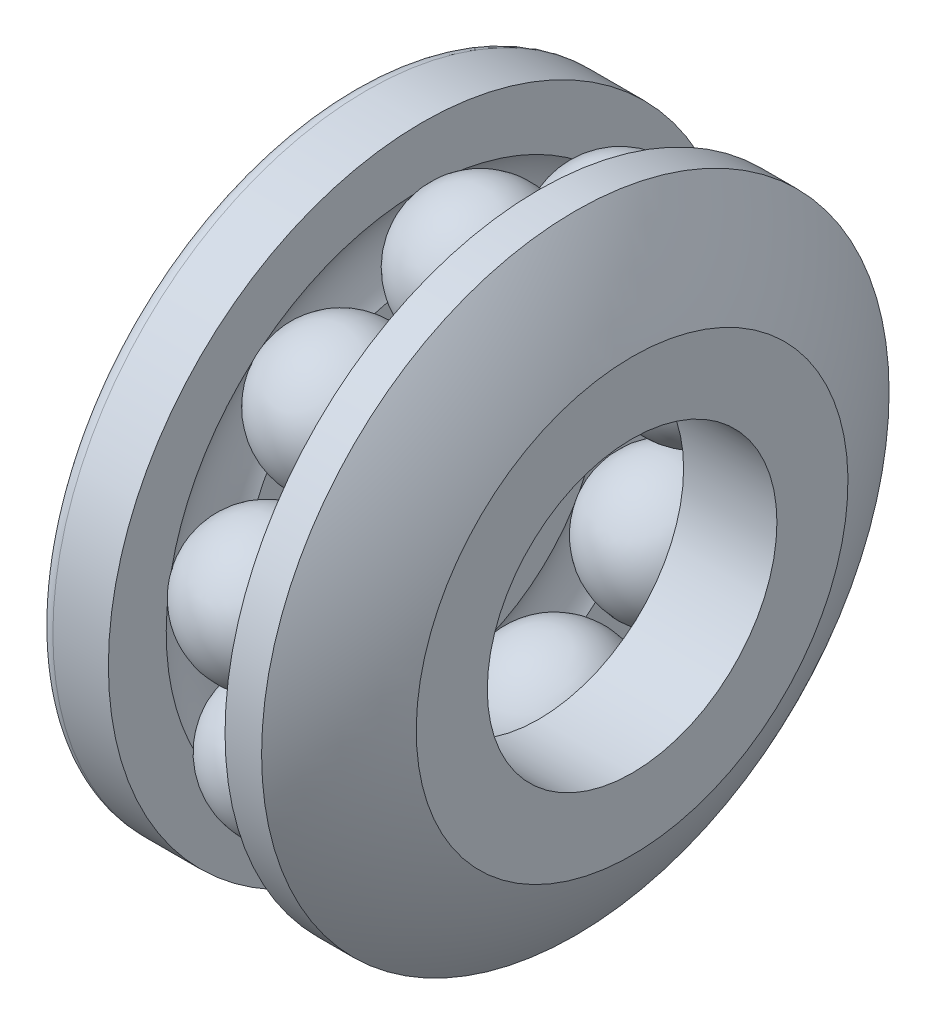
ISO-10303-21;
HEADER;
FILE_DESCRIPTION(('STEP AP214'),'2;1');
FILE_NAME('part.step','',(''),(''),'','','');
FILE_SCHEMA(('AUTOMOTIVE_DESIGN { 1 0 10303 214 1 1 1 1 }'));
ENDSEC;
DATA;
#1=APPLICATION_CONTEXT('core data for automotive mechanical design processes');
#2=APPLICATION_PROTOCOL_DEFINITION('international standard','automotive_design',2000,#1);
#3=PRODUCT_CONTEXT('',#1,'mechanical');
#4=PRODUCT('Part','Part','',(#3));
#5=PRODUCT_RELATED_PRODUCT_CATEGORY('part','',(#4));
#6=PRODUCT_DEFINITION_FORMATION('','',#4);
#7=PRODUCT_DEFINITION_CONTEXT('part definition',#1,'design');
#8=PRODUCT_DEFINITION('design','',#6,#7);
#9=PRODUCT_DEFINITION_SHAPE('','',#8);
#10=(LENGTH_UNIT() NAMED_UNIT(*) SI_UNIT(.MILLI.,.METRE.));
#11=(NAMED_UNIT(*) PLANE_ANGLE_UNIT() SI_UNIT($,.RADIAN.));
#12=(NAMED_UNIT(*) SI_UNIT($,.STERADIAN.) SOLID_ANGLE_UNIT());
#13=UNCERTAINTY_MEASURE_WITH_UNIT(LENGTH_MEASURE(1.E-05),#10,'distance_accuracy_value','');
#14=(GEOMETRIC_REPRESENTATION_CONTEXT(3) GLOBAL_UNCERTAINTY_ASSIGNED_CONTEXT((#13)) GLOBAL_UNIT_ASSIGNED_CONTEXT((#10,
#11,#12)) REPRESENTATION_CONTEXT('',''));
#15=CARTESIAN_POINT('',(0.,0.,0.));
#16=DIRECTION('',(0.,0.,1.));
#17=DIRECTION('',(1.,0.,0.));
#18=AXIS2_PLACEMENT_3D('',#15,#16,#17);
#19=CARTESIAN_POINT('',(0.,0.,0.));
#20=DIRECTION('',(1.,0.,0.));
#21=DIRECTION('',(0.,1.,0.));
#22=AXIS2_PLACEMENT_3D('',#19,#20,#21);
#23=TOROIDAL_SURFACE('',#22,9.,2.9);
#24=CARTESIAN_POINT('',(-2.41646666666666,7.95199466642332,7.01402393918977));
#25=CARTESIAN_POINT('',(-2.46157361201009,7.90046665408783,6.96969209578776));
#26=CARTESIAN_POINT('',(-2.50379730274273,7.8474945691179,6.92411250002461));
#27=CARTESIAN_POINT('',(-2.58221015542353,7.73905262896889,6.83079170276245));
#28=CARTESIAN_POINT('',(-2.61839960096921,7.68358289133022,6.783050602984));
#29=CARTESIAN_POINT('',(-2.68445433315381,7.5705754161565,6.68577461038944));
#30=CARTESIAN_POINT('',(-2.71432455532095,7.51303933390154,6.63624115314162));
#31=CARTESIAN_POINT('',(-2.76756496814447,7.39629087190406,6.53571584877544));
#32=CARTESIAN_POINT('',(-2.79093524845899,7.33707851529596,6.48472402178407));
#33=CARTESIAN_POINT('',(-2.85103683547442,7.15749536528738,6.33004760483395));
#34=CARTESIAN_POINT('',(-2.87779163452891,7.03512233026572,6.22461373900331));
#35=CARTESIAN_POINT('',(-2.90378294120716,6.78880671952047,6.01231759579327));
#36=CARTESIAN_POINT('',(-2.90301870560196,6.66486410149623,5.90545527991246));
#37=CARTESIAN_POINT('',(-2.87403874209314,6.41881577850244,5.69323312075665));
#38=CARTESIAN_POINT('',(-2.84581031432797,6.29671094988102,5.58787399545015));
#39=CARTESIAN_POINT('',(-2.76265507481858,6.05791745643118,5.38174659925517));
#40=CARTESIAN_POINT('',(-2.70775148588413,5.94122417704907,5.28097441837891));
#41=CARTESIAN_POINT('',(-2.60847834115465,5.77579647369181,5.13805940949));
#42=CARTESIAN_POINT('',(-2.57377236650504,5.72361814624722,5.09297281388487));
#43=CARTESIAN_POINT('',(-2.49905154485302,5.62162671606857,5.00482648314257));
#44=CARTESIAN_POINT('',(-2.45904719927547,5.57180919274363,4.96176296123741));
#45=CARTESIAN_POINT('',(-2.41646666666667,5.5232555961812,4.91978397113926));
#46=B_SPLINE_CURVE_WITH_KNOTS('',3,(#24,#25,#26,#27,#28,#29,#30,#31,#32,#33,#34,#35,#36,#37,#38,
#39,#40,#41,#42,#43,#44,#45),.UNSPECIFIED.,.F.,.F.,(4,2,2,2,2,2,2,2,2,2,4),(0.,
0.244656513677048,0.48930152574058,0.733754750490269,0.978204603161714,1.46686433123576,
1.95553725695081,2.44443625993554,2.93291039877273,3.1643026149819,3.39524288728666),.UNSPECIFIED.);
#47=CARTESIAN_POINT('',(-2.41666666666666,7.95176611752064,7.01382730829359));
#48=VERTEX_POINT('',#47);
#49=CARTESIAN_POINT('',(-2.41666666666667,5.52348367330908,4.91998116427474));
#50=VERTEX_POINT('',#49);
#51=EDGE_CURVE('E50',#48,#50,#46,.T.);
#52=ORIENTED_EDGE('',*,*,#51,.F.);
#53=CARTESIAN_POINT('',(-2.41666666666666,0.,0.));
#54=DIRECTION('',(1.,0.,0.));
#55=DIRECTION('',(0.,1.,0.));
#56=AXIS2_PLACEMENT_3D('',#53,#54,#55);
#57=CIRCLE('',#56,10.6030353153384);
#58=CARTESIAN_POINT('',(-2.41666666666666,2.09826956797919,10.393345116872));
#59=VERTEX_POINT('',#58);
#60=EDGE_CURVE('E815',#48,#59,#57,.T.);
#61=ORIENTED_EDGE('',*,*,#60,.T.);
#62=CARTESIAN_POINT('',(-2.41646666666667,1.49903010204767,7.24317164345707));
#63=CARTESIAN_POINT('',(-2.46112142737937,1.51169352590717,7.30926465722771));
#64=CARTESIAN_POINT('',(-2.50295072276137,1.52470204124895,7.37719556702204));
#65=CARTESIAN_POINT('',(-2.58069675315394,1.55131407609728,7.51624266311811));
#66=CARTESIAN_POINT('',(-2.61661392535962,1.56491755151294,7.58735861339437));
#67=CARTESIAN_POINT('',(-2.68227309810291,1.59262299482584,7.73227827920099));
#68=CARTESIAN_POINT('',(-2.71201653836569,1.60672484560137,7.80608136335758));
#69=CARTESIAN_POINT('',(-2.76513262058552,1.63532556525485,7.95584829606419));
#70=CARTESIAN_POINT('',(-2.78850514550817,1.64982444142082,8.03181218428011));
#71=CARTESIAN_POINT('',(-2.85040681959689,1.69494389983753,8.26833595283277));
#72=CARTESIAN_POINT('',(-2.87809999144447,1.72608876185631,8.43178247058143));
#73=CARTESIAN_POINT('',(-2.90427546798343,1.78871678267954,8.76080448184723));
#74=CARTESIAN_POINT('',(-2.90276630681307,1.8201998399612,8.92637933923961));
#75=CARTESIAN_POINT('',(-2.87205237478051,1.87991070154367,9.24071391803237));
#76=CARTESIAN_POINT('',(-2.84522545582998,1.90818676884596,9.38970141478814));
#77=CARTESIAN_POINT('',(-2.76792519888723,1.96353836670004,9.68158248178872));
#78=CARTESIAN_POINT('',(-2.71747149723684,1.99061487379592,9.82448100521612));
#79=CARTESIAN_POINT('',(-2.62237610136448,2.03097154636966,10.037614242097));
#80=CARTESIAN_POINT('',(-2.58555064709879,2.04491933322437,10.1113051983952));
#81=CARTESIAN_POINT('',(-2.50563875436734,2.07214204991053,10.2551828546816));
#82=CARTESIAN_POINT('',(-2.46256237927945,2.08541801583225,10.32537494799));
#83=CARTESIAN_POINT('',(-2.41646666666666,2.0983255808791,10.3936413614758));
#84=B_SPLINE_CURVE_WITH_KNOTS('',3,(#62,#63,#64,#65,#66,#67,#68,#69,#70,#71,#72,#73,#74,#75,#76,
#77,#78,#79,#80,#81,#82,#83),.UNSPECIFIED.,.F.,.F.,(4,2,2,2,2,2,2,2,2,2,4),(0.,
0.242212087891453,0.484406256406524,0.726543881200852,0.968685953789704,1.47195323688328,
1.97507344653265,2.43519766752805,2.89494015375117,3.14532189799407,3.39530493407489),.UNSPECIFIED.);
#85=CARTESIAN_POINT('',(-2.41666666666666,1.49908683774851,7.24346776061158));
#86=VERTEX_POINT('',#85);
#87=EDGE_CURVE('E538',#86,#59,#84,.T.);
#88=ORIENTED_EDGE('',*,*,#87,.F.);
#89=CARTESIAN_POINT('',(-2.41666666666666,0.,0.));
#90=DIRECTION('',(1.,0.,0.));
#91=DIRECTION('',(0.,1.,0.));
#92=AXIS2_PLACEMENT_3D('',#89,#90,#91);
#93=CIRCLE('',#92,7.39696468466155);
#94=EDGE_CURVE('E814',#50,#86,#93,.T.);
#95=ORIENTED_EDGE('',*,*,#94,.F.);
#96=EDGE_LOOP('',(#52,#61,#88,#95));
#97=FACE_BOUND('',#96,.T.);
#98=ADVANCED_FACE('F35',(#97),#23,.F.);
#99=CARTESIAN_POINT('',(-2.41646666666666,5.80414466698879,4.58503341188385));
#100=CARTESIAN_POINT('',(-2.46112142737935,5.8563291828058,4.62752370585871));
#101=CARTESIAN_POINT('',(-2.50295072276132,5.90995943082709,4.67120008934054));
#102=CARTESIAN_POINT('',(-2.58069675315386,6.01972318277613,4.76061045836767));
#103=CARTESIAN_POINT('',(-2.61661392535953,6.07585650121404,4.80634429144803));
#104=CARTESIAN_POINT('',(-2.6822730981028,6.19023266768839,4.89955048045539));
#105=CARTESIAN_POINT('',(-2.71201653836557,6.24847502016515,4.94702242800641));
#106=CARTESIAN_POINT('',(-2.76513262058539,6.3666527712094,5.04336636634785));
#107=CARTESIAN_POINT('',(-2.78850514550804,6.42658820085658,5.09223838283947));
#108=CARTESIAN_POINT('',(-2.85040681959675,6.6131862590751,5.24442387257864));
#109=CARTESIAN_POINT('',(-2.87809999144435,6.74210600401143,5.34961163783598));
#110=CARTESIAN_POINT('',(-2.9042754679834,7.00157312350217,5.56140060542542));
#111=CARTESIAN_POINT('',(-2.90276630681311,7.1321200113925,5.66800138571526));
#112=CARTESIAN_POINT('',(-2.87205237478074,7.37991155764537,5.87041424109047));
#113=CARTESIAN_POINT('',(-2.84522545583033,7.49733959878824,5.96636977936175));
#114=CARTESIAN_POINT('',(-2.76792519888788,7.72735891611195,6.15438432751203));
#115=CARTESIAN_POINT('',(-2.71747149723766,7.83995412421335,6.24644650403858));
#116=CARTESIAN_POINT('',(-2.6223761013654,8.00786853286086,6.38377526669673));
#117=CARTESIAN_POINT('',(-2.58555064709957,8.06592079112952,6.43126034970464));
#118=CARTESIAN_POINT('',(-2.50563875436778,8.17925737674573,6.52397860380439));
#119=CARTESIAN_POINT('',(-2.46256237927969,8.23454596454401,6.56921524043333));
#120=CARTESIAN_POINT('',(-2.41646666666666,8.28831453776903,6.61321352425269));
#121=B_SPLINE_CURVE_WITH_KNOTS('',3,(#99,#100,#101,#102,#103,#104,#105,#106,#107,#108,#109,#110,
#111,#112,#113,#114,#115,#116,#117,#118,#119,#120),.UNSPECIFIED.,.F.,.F.,(4,2,2,2,2,2,2,2,2,2,
4),(0.,0.242212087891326,0.484406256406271,0.726543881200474,0.968685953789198,1.47195323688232,
1.97507344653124,2.43519766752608,2.89494015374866,3.14532189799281,3.39530493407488),.UNSPECIFIED.);
#122=CARTESIAN_POINT('',(-2.41666666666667,5.80437846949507,4.58522378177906));
#123=VERTEX_POINT('',#122);
#124=CARTESIAN_POINT('',(-2.41666666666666,8.28808120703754,6.61302259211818));
#125=VERTEX_POINT('',#124);
#126=EDGE_CURVE('E517',#123,#125,#121,.T.);
#127=ORIENTED_EDGE('',*,*,#126,.F.);
#128=CARTESIAN_POINT('',(-2.41666666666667,7.39373690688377,0.218497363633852));
#129=VERTEX_POINT('',#128);
#130=EDGE_CURVE('E840',#129,#123,#93,.T.);
#131=ORIENTED_EDGE('',*,*,#130,.F.);
#132=CARTESIAN_POINT('',(-2.41646666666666,10.6001090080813,0.261610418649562));
#133=CARTESIAN_POINT('',(-2.46157361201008,10.5321403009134,0.260771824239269));
#134=CARTESIAN_POINT('',(-2.50379730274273,10.4622633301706,0.259905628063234));
#135=CARTESIAN_POINT('',(-2.58221015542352,10.3192065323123,0.258122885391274));
#136=CARTESIAN_POINT('',(-2.61839960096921,10.2460268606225,0.257206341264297));
#137=CARTESIAN_POINT('',(-2.68445433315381,10.096930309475,0.255328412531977));
#138=CARTESIAN_POINT('',(-2.71432455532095,10.0210156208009,0.25436706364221));
#139=CARTESIAN_POINT('',(-2.76756496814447,9.86696469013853,0.252404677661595));
#140=CARTESIAN_POINT('',(-2.79093524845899,9.78882847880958,0.251403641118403));
#141=CARTESIAN_POINT('',(-2.85103683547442,9.55183572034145,0.248348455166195));
#142=CARTESIAN_POINT('',(-2.87779163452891,9.39032095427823,0.246241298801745));
#143=CARTESIAN_POINT('',(-2.90378294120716,9.06517091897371,0.241941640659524));
#144=CARTESIAN_POINT('',(-2.90301870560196,8.90153559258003,0.239749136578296));
#145=CARTESIAN_POINT('',(-2.87403874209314,8.57663786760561,0.235334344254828));
#146=CARTESIAN_POINT('',(-2.84581031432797,8.41537660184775,0.233112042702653));
#147=CARTESIAN_POINT('',(-2.76265507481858,8.09995403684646,0.228702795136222));
#148=CARTESIAN_POINT('',(-2.70775148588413,7.9457866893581,0.226515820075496));
#149=CARTESIAN_POINT('',(-2.60847834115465,7.7271977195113,0.223371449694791));
#150=CARTESIAN_POINT('',(-2.57377236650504,7.65824569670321,0.222372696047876));
#151=CARTESIAN_POINT('',(-2.49905154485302,7.52345635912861,0.220407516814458));
#152=CARTESIAN_POINT('',(-2.45904719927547,7.45761322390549,0.21944103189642));
#153=CARTESIAN_POINT('',(-2.41646666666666,7.39343543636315,0.218492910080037));
#154=B_SPLINE_CURVE_WITH_KNOTS('',3,(#132,#133,#134,#135,#136,#137,#138,#139,#140,#141,#142,
#143,#144,#145,#146,#147,#148,#149,#150,#151,#152,#153),.UNSPECIFIED.,.F.,.F.,(4,2,2,2,2,2,2,2,
2,2,4),(0.,0.244656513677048,0.489301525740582,0.733754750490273,0.978204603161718,
1.46686433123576,1.95553725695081,2.44443625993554,2.93291039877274,3.16430261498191,
3.39524288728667),.UNSPECIFIED.);
#155=CARTESIAN_POINT('',(-2.41666666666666,10.5998075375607,0.261606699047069));
#156=VERTEX_POINT('',#155);
#157=EDGE_CURVE('E324',#156,#129,#154,.T.);
#158=ORIENTED_EDGE('',*,*,#157,.F.);
#159=EDGE_CURVE('E816',#156,#125,#57,.T.);
#160=ORIENTED_EDGE('',*,*,#159,.T.);
#161=EDGE_LOOP('',(#127,#131,#158,#160));
#162=FACE_BOUND('',#161,.T.);
#163=ADVANCED_FACE('F845',(#162),#23,.F.);
#164=CARTESIAN_POINT('',(-2.41666666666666,0.,0.));
#165=DIRECTION('',(-1.,0.,0.));
#166=DIRECTION('',(0.,-1.,0.));
#167=AXIS2_PLACEMENT_3D('',#164,#165,#166);
#168=PLANE('',#167);
#169=CARTESIAN_POINT('',(-2.41666666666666,0.,0.));
#170=DIRECTION('',(1.,0.,0.));
#171=DIRECTION('',(0.,1.,0.));
#172=AXIS2_PLACEMENT_3D('',#169,#170,#171);
#173=CIRCLE('',#172,13.);
#174=CARTESIAN_POINT('',(-2.41666666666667,13.,0.));
#175=VERTEX_POINT('',#174);
#176=EDGE_CURVE('E832',#175,#175,#173,.T.);
#177=ORIENTED_EDGE('',*,*,#176,.T.);
#178=EDGE_LOOP('',(#177));
#179=FACE_BOUND('',#178,.T.);
#180=CARTESIAN_POINT('',(-2.41666666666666,6.89439998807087,5.78508848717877));
#181=DIRECTION('',(-1.,0.,0.));
#182=DIRECTION('',(0.,-1.,0.));
#183=AXIS2_PLACEMENT_3D('',#180,#181,#182);
#184=CIRCLE('',#183,1.62105589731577);
#185=EDGE_CURVE('E57',#125,#48,#184,.F.);
#186=ORIENTED_EDGE('',*,*,#185,.F.);
#187=ORIENTED_EDGE('',*,*,#159,.F.);
#188=CARTESIAN_POINT('',(-2.41666666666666,9.,0.));
#189=DIRECTION('',(-1.,0.,0.));
#190=DIRECTION('',(0.,-1.,0.));
#191=AXIS2_PLACEMENT_3D('',#188,#189,#190);
#192=CIRCLE('',#191,1.62105589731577);
#193=CARTESIAN_POINT('',(-2.41666666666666,10.5998075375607,-0.261606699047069));
#194=VERTEX_POINT('',#193);
#195=EDGE_CURVE('E852',#194,#156,#192,.F.);
#196=ORIENTED_EDGE('',*,*,#195,.F.);
#197=CARTESIAN_POINT('',(-2.41666666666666,8.28808120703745,-6.61302259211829));
#198=VERTEX_POINT('',#197);
#199=EDGE_CURVE('E831',#198,#194,#57,.T.);
#200=ORIENTED_EDGE('',*,*,#199,.F.);
#201=CARTESIAN_POINT('',(-2.41666666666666,6.89439998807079,-5.78508848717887));
#202=DIRECTION('',(-1.,0.,0.));
#203=DIRECTION('',(0.,-1.,0.));
#204=AXIS2_PLACEMENT_3D('',#201,#202,#203);
#205=CIRCLE('',#204,1.62105589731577);
#206=CARTESIAN_POINT('',(-2.41666666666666,7.95176611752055,-7.0138273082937));
#207=VERTEX_POINT('',#206);
#208=EDGE_CURVE('E738',#207,#198,#205,.F.);
#209=ORIENTED_EDGE('',*,*,#208,.F.);
#210=CARTESIAN_POINT('',(-2.41666666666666,2.09826956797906,-10.393345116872));
#211=VERTEX_POINT('',#210);
#212=EDGE_CURVE('E886',#211,#207,#57,.T.);
#213=ORIENTED_EDGE('',*,*,#212,.F.);
#214=CARTESIAN_POINT('',(-2.41666666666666,1.56283359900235,-8.86326977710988));
#215=DIRECTION('',(-1.,0.,0.));
#216=DIRECTION('',(0.,-1.,0.));
#217=AXIS2_PLACEMENT_3D('',#214,#215,#216);
#218=CIRCLE('',#217,1.62105589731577);
#219=CARTESIAN_POINT('',(-2.41666666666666,1.58300495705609,-10.484200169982));
#220=VERTEX_POINT('',#219);
#221=EDGE_CURVE('E707',#220,#211,#218,.F.);
#222=ORIENTED_EDGE('',*,*,#221,.F.);
#223=CARTESIAN_POINT('',(-2.41666666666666,-5.07334572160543,-9.31050595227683));
#224=VERTEX_POINT('',#223);
#225=EDGE_CURVE('E874',#224,#220,#57,.T.);
#226=ORIENTED_EDGE('',*,*,#225,.F.);
#227=CARTESIAN_POINT('',(-2.41666666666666,-4.50000000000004,-7.79422863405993));
#228=DIRECTION('',(-1.,0.,0.));
#229=DIRECTION('',(0.,-1.,0.));
#230=AXIS2_PLACEMENT_3D('',#227,#228,#229);
#231=CIRCLE('',#230,1.62105589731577);
#232=CARTESIAN_POINT('',(-2.41666666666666,-5.52646181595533,-9.04889925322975));
#233=VERTEX_POINT('',#232);
#234=EDGE_CURVE('E876',#233,#224,#231,.F.);
#235=ORIENTED_EDGE('',*,*,#234,.F.);
#236=CARTESIAN_POINT('',(-2.41666666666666,-9.8710861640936,-3.87117757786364));
#237=VERTEX_POINT('',#236);
#238=EDGE_CURVE('E884',#237,#233,#57,.T.);
#239=ORIENTED_EDGE('',*,*,#238,.F.);
#240=CARTESIAN_POINT('',(-2.41666666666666,-8.4572335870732,-3.07818128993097));
#241=DIRECTION('',(-1.,0.,0.));
#242=DIRECTION('',(0.,-1.,0.));
#243=AXIS2_PLACEMENT_3D('',#240,#241,#242);
#244=CIRCLE('',#243,1.62105589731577);
#245=CARTESIAN_POINT('',(-2.41666666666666,-10.0500356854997,-3.37951780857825));
#246=VERTEX_POINT('',#245);
#247=EDGE_CURVE('E646',#246,#237,#244,.F.);
#248=ORIENTED_EDGE('',*,*,#247,.F.);
#249=CARTESIAN_POINT('',(-2.41666666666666,-10.0500356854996,3.37951780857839));
#250=VERTEX_POINT('',#249);
#251=EDGE_CURVE('E828',#250,#246,#57,.T.);
#252=ORIENTED_EDGE('',*,*,#251,.F.);
#253=CARTESIAN_POINT('',(-2.41666666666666,-8.45723358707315,3.07818128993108));
#254=DIRECTION('',(-1.,0.,0.));
#255=DIRECTION('',(0.,-1.,0.));
#256=AXIS2_PLACEMENT_3D('',#253,#254,#255);
#257=CIRCLE('',#256,1.62105589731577);
#258=CARTESIAN_POINT('',(-2.41666666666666,-9.87108616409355,3.87117757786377));
#259=VERTEX_POINT('',#258);
#260=EDGE_CURVE('E614',#259,#250,#257,.F.);
#261=ORIENTED_EDGE('',*,*,#260,.F.);
#262=CARTESIAN_POINT('',(-2.41666666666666,-5.5264618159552,9.04889925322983));
#263=VERTEX_POINT('',#262);
#264=EDGE_CURVE('E827',#263,#259,#57,.T.);
#265=ORIENTED_EDGE('',*,*,#264,.F.);
#266=CARTESIAN_POINT('',(-2.41666666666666,-4.49999999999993,7.79422863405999));
#267=DIRECTION('',(-1.,0.,0.));
#268=DIRECTION('',(0.,-1.,0.));
#269=AXIS2_PLACEMENT_3D('',#266,#267,#268);
#270=CIRCLE('',#269,1.62105589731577);
#271=CARTESIAN_POINT('',(-2.41666666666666,-5.0733457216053,9.3105059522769));
#272=VERTEX_POINT('',#271);
#273=EDGE_CURVE('E766',#272,#263,#270,.F.);
#274=ORIENTED_EDGE('',*,*,#273,.F.);
#275=CARTESIAN_POINT('',(-2.41666666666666,1.58300495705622,10.484200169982));
#276=VERTEX_POINT('',#275);
#277=EDGE_CURVE('E817',#276,#272,#57,.T.);
#278=ORIENTED_EDGE('',*,*,#277,.F.);
#279=CARTESIAN_POINT('',(-2.41666666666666,1.56283359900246,8.86326977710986));
#280=DIRECTION('',(-1.,0.,0.));
#281=DIRECTION('',(0.,-1.,0.));
#282=AXIS2_PLACEMENT_3D('',#279,#280,#281);
#283=CIRCLE('',#282,1.62105589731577);
#284=EDGE_CURVE('E553',#59,#276,#283,.F.);
#285=ORIENTED_EDGE('',*,*,#284,.F.);
#286=ORIENTED_EDGE('',*,*,#60,.F.);
#287=EDGE_LOOP('',(#186,#187,#196,#200,#209,#213,#222,#226,#235,#239,#248,#252,#261,#265,#274,
#278,#285,#286));
#288=FACE_BOUND('',#287,.T.);
#289=ADVANCED_FACE('F820',(#179,#288),#168,.F.);
#290=CARTESIAN_POINT('',(-2.41666666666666,0.,0.));
#291=DIRECTION('',(-1.,0.,0.));
#292=DIRECTION('',(0.,-1.,0.));
#293=AXIS2_PLACEMENT_3D('',#290,#291,#292);
#294=PLANE('',#293);
#295=CARTESIAN_POINT('',(-2.41666666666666,0.,0.));
#296=DIRECTION('',(1.,0.,0.));
#297=DIRECTION('',(0.,1.,0.));
#298=AXIS2_PLACEMENT_3D('',#295,#296,#297);
#299=CIRCLE('',#298,5.);
#300=CARTESIAN_POINT('',(-2.41666666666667,5.,0.));
#301=VERTEX_POINT('',#300);
#302=EDGE_CURVE('E847',#301,#301,#299,.T.);
#303=ORIENTED_EDGE('',*,*,#302,.F.);
#304=EDGE_LOOP('',(#303));
#305=FACE_BOUND('',#304,.T.);
#306=CARTESIAN_POINT('',(-2.41666666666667,6.89439998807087,5.78508848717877));
#307=DIRECTION('',(-1.,0.,0.));
#308=DIRECTION('',(0.,-1.,0.));
#309=AXIS2_PLACEMENT_3D('',#306,#307,#308);
#310=CIRCLE('',#309,1.62105589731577);
#311=EDGE_CURVE('E524',#50,#123,#310,.F.);
#312=ORIENTED_EDGE('',*,*,#311,.F.);
#313=ORIENTED_EDGE('',*,*,#94,.T.);
#314=CARTESIAN_POINT('',(-2.41666666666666,1.56283359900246,8.86326977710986));
#315=DIRECTION('',(-1.,0.,0.));
#316=DIRECTION('',(0.,-1.,0.));
#317=AXIS2_PLACEMENT_3D('',#314,#315,#316);
#318=CIRCLE('',#317,1.62105589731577);
#319=CARTESIAN_POINT('',(-2.41666666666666,1.06873104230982,7.31935109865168));
#320=VERTEX_POINT('',#319);
#321=EDGE_CURVE('E534',#320,#86,#318,.F.);
#322=ORIENTED_EDGE('',*,*,#321,.F.);
#323=CARTESIAN_POINT('',(-2.41666666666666,-3.50764418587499,6.51241267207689));
#324=VERTEX_POINT('',#323);
#325=EDGE_CURVE('E850',#320,#324,#93,.T.);
#326=ORIENTED_EDGE('',*,*,#325,.T.);
#327=CARTESIAN_POINT('',(-2.41666666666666,-4.49999999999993,7.79422863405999));
#328=DIRECTION('',(-1.,0.,0.));
#329=DIRECTION('',(0.,-1.,0.));
#330=AXIS2_PLACEMENT_3D('',#327,#328,#329);
#331=CIRCLE('',#330,1.62105589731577);
#332=CARTESIAN_POINT('',(-2.41666666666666,-3.88609272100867,6.29391530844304));
#333=VERTEX_POINT('',#332);
#334=EDGE_CURVE('E565',#333,#324,#331,.F.);
#335=ORIENTED_EDGE('',*,*,#334,.F.);
#336=CARTESIAN_POINT('',(-2.41666666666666,-6.87310951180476,2.73412731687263));
#337=VERTEX_POINT('',#336);
#338=EDGE_CURVE('E858',#333,#337,#93,.T.);
#339=ORIENTED_EDGE('',*,*,#338,.T.);
#340=CARTESIAN_POINT('',(-2.41666666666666,-8.45723358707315,3.07818128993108));
#341=DIRECTION('',(-1.,0.,0.));
#342=DIRECTION('',(0.,-1.,0.));
#343=AXIS2_PLACEMENT_3D('',#340,#341,#342);
#344=CIRCLE('',#343,1.62105589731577);
#345=CARTESIAN_POINT('',(-2.41666666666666,-7.02257051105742,2.32348659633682));
#346=VERTEX_POINT('',#345);
#347=EDGE_CURVE('E608',#346,#337,#344,.F.);
#348=ORIENTED_EDGE('',*,*,#347,.F.);
#349=CARTESIAN_POINT('',(-2.41666666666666,-7.02257051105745,-2.32348659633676));
#350=VERTEX_POINT('',#349);
#351=EDGE_CURVE('E859',#346,#350,#93,.T.);
#352=ORIENTED_EDGE('',*,*,#351,.T.);
#353=CARTESIAN_POINT('',(-2.41666666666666,-8.4572335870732,-3.07818128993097));
#354=DIRECTION('',(-1.,0.,0.));
#355=DIRECTION('',(0.,-1.,0.));
#356=AXIS2_PLACEMENT_3D('',#353,#354,#355);
#357=CIRCLE('',#356,1.62105589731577);
#358=CARTESIAN_POINT('',(-2.41666666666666,-6.87310951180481,-2.73412731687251));
#359=VERTEX_POINT('',#358);
#360=EDGE_CURVE('E628',#359,#350,#357,.F.);
#361=ORIENTED_EDGE('',*,*,#360,.F.);
#362=CARTESIAN_POINT('',(-2.41666666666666,-3.88609272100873,-6.293915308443));
#363=VERTEX_POINT('',#362);
#364=EDGE_CURVE('E862',#359,#363,#93,.T.);
#365=ORIENTED_EDGE('',*,*,#364,.T.);
#366=CARTESIAN_POINT('',(-2.41666666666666,-4.50000000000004,-7.79422863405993));
#367=DIRECTION('',(-1.,0.,0.));
#368=DIRECTION('',(0.,-1.,0.));
#369=AXIS2_PLACEMENT_3D('',#366,#367,#368);
#370=CIRCLE('',#369,1.62105589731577);
#371=CARTESIAN_POINT('',(-2.41666666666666,-3.5076441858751,-6.51241267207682));
#372=VERTEX_POINT('',#371);
#373=EDGE_CURVE('E658',#372,#363,#370,.F.);
#374=ORIENTED_EDGE('',*,*,#373,.F.);
#375=CARTESIAN_POINT('',(-2.41666666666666,1.06873104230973,-7.31935109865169));
#376=VERTEX_POINT('',#375);
#377=EDGE_CURVE('E853',#372,#376,#93,.T.);
#378=ORIENTED_EDGE('',*,*,#377,.T.);
#379=CARTESIAN_POINT('',(-2.41666666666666,1.56283359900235,-8.86326977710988));
#380=DIRECTION('',(-1.,0.,0.));
#381=DIRECTION('',(0.,-1.,0.));
#382=AXIS2_PLACEMENT_3D('',#379,#380,#381);
#383=CIRCLE('',#382,1.62105589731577);
#384=CARTESIAN_POINT('',(-2.41666666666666,1.49908683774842,-7.2434677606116));
#385=VERTEX_POINT('',#384);
#386=EDGE_CURVE('E701',#385,#376,#383,.F.);
#387=ORIENTED_EDGE('',*,*,#386,.F.);
#388=CARTESIAN_POINT('',(-2.41666666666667,5.52348367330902,-4.91998116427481));
#389=VERTEX_POINT('',#388);
#390=EDGE_CURVE('E851',#385,#389,#93,.T.);
#391=ORIENTED_EDGE('',*,*,#390,.T.);
#392=CARTESIAN_POINT('',(-2.41666666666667,6.89439998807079,-5.78508848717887));
#393=DIRECTION('',(-1.,0.,0.));
#394=DIRECTION('',(0.,-1.,0.));
#395=AXIS2_PLACEMENT_3D('',#392,#393,#394);
#396=CIRCLE('',#395,1.62105589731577);
#397=CARTESIAN_POINT('',(-2.41666666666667,5.80437846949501,-4.58522378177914));
#398=VERTEX_POINT('',#397);
#399=EDGE_CURVE('E720',#398,#389,#396,.F.);
#400=ORIENTED_EDGE('',*,*,#399,.F.);
#401=CARTESIAN_POINT('',(-2.41666666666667,7.39373690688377,-0.218497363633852));
#402=VERTEX_POINT('',#401);
#403=EDGE_CURVE('E843',#398,#402,#93,.T.);
#404=ORIENTED_EDGE('',*,*,#403,.T.);
#405=CARTESIAN_POINT('',(-2.41666666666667,9.,0.));
#406=DIRECTION('',(-1.,0.,0.));
#407=DIRECTION('',(0.,-1.,0.));
#408=AXIS2_PLACEMENT_3D('',#405,#406,#407);
#409=CIRCLE('',#408,1.62105589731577);
#410=EDGE_CURVE('E830',#129,#402,#409,.F.);
#411=ORIENTED_EDGE('',*,*,#410,.F.);
#412=ORIENTED_EDGE('',*,*,#130,.T.);
#413=EDGE_LOOP('',(#312,#313,#322,#326,#335,#339,#348,#352,#361,#365,#374,#378,#387,#391,#400,
#404,#411,#412));
#414=FACE_BOUND('',#413,.T.);
#415=ADVANCED_FACE('F342',(#305,#414),#294,.F.);
#416=CARTESIAN_POINT('',(2.41666666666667,13.,0.));
#417=DIRECTION('',(-1.,0.,0.));
#418=DIRECTION('',(0.,-1.,0.));
#419=AXIS2_PLACEMENT_3D('',#416,#417,#418);
#420=PLANE('',#419);
#421=CARTESIAN_POINT('',(2.41666666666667,0.,0.));
#422=DIRECTION('',(1.,0.,0.));
#423=DIRECTION('',(0.,1.,0.));
#424=AXIS2_PLACEMENT_3D('',#421,#422,#423);
#425=CIRCLE('',#424,13.);
#426=CARTESIAN_POINT('',(2.41666666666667,13.,0.));
#427=VERTEX_POINT('',#426);
#428=EDGE_CURVE('E303',#427,#427,#425,.T.);
#429=ORIENTED_EDGE('',*,*,#428,.F.);
#430=EDGE_LOOP('',(#429));
#431=FACE_BOUND('',#430,.T.);
#432=CARTESIAN_POINT('',(2.41666666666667,0.,0.));
#433=DIRECTION('',(1.,0.,0.));
#434=DIRECTION('',(0.,1.,0.));
#435=AXIS2_PLACEMENT_3D('',#432,#433,#434);
#436=CIRCLE('',#435,10.6030353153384);
#437=CARTESIAN_POINT('',(2.41666666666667,10.5998075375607,0.261606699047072));
#438=VERTEX_POINT('',#437);
#439=CARTESIAN_POINT('',(2.41666666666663,8.28808120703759,6.61302259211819));
#440=VERTEX_POINT('',#439);
#441=EDGE_CURVE('E300',#438,#440,#436,.T.);
#442=ORIENTED_EDGE('',*,*,#441,.T.);
#443=CARTESIAN_POINT('',(2.41666666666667,6.89439998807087,5.78508848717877));
#444=DIRECTION('',(-1.,0.,0.));
#445=DIRECTION('',(0.,-1.,0.));
#446=AXIS2_PLACEMENT_3D('',#443,#444,#445);
#447=CIRCLE('',#446,1.62105589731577);
#448=CARTESIAN_POINT('',(2.41666666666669,7.9517661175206,7.01382730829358));
#449=VERTEX_POINT('',#448);
#450=EDGE_CURVE('E285',#440,#449,#447,.F.);
#451=ORIENTED_EDGE('',*,*,#450,.T.);
#452=CARTESIAN_POINT('',(2.41666666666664,2.0982695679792,10.393345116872));
#453=VERTEX_POINT('',#452);
#454=EDGE_CURVE('E284',#449,#453,#436,.T.);
#455=ORIENTED_EDGE('',*,*,#454,.T.);
#456=CARTESIAN_POINT('',(2.41666666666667,1.56283359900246,8.86326977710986));
#457=DIRECTION('',(-1.,0.,0.));
#458=DIRECTION('',(0.,-1.,0.));
#459=AXIS2_PLACEMENT_3D('',#456,#457,#458);
#460=CIRCLE('',#459,1.62105589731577);
#461=CARTESIAN_POINT('',(2.41666666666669,1.58300495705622,10.4842001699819));
#462=VERTEX_POINT('',#461);
#463=EDGE_CURVE('E530',#453,#462,#460,.F.);
#464=ORIENTED_EDGE('',*,*,#463,.T.);
#465=CARTESIAN_POINT('',(2.41666666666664,-5.07334572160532,9.31050595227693));
#466=VERTEX_POINT('',#465);
#467=EDGE_CURVE('E810',#462,#466,#436,.T.);
#468=ORIENTED_EDGE('',*,*,#467,.T.);
#469=CARTESIAN_POINT('',(2.41666666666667,-4.49999999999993,7.79422863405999));
#470=DIRECTION('',(-1.,0.,0.));
#471=DIRECTION('',(0.,-1.,0.));
#472=AXIS2_PLACEMENT_3D('',#469,#470,#471);
#473=CIRCLE('',#472,1.62105589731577);
#474=CARTESIAN_POINT('',(2.41666666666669,-5.52646181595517,9.04889925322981));
#475=VERTEX_POINT('',#474);
#476=EDGE_CURVE('E562',#466,#475,#473,.F.);
#477=ORIENTED_EDGE('',*,*,#476,.T.);
#478=CARTESIAN_POINT('',(2.41666666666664,-9.8710861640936,3.87117757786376));
#479=VERTEX_POINT('',#478);
#480=EDGE_CURVE('E809',#475,#479,#436,.T.);
#481=ORIENTED_EDGE('',*,*,#480,.T.);
#482=CARTESIAN_POINT('',(2.41666666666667,-8.45723358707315,3.07818128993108));
#483=DIRECTION('',(-1.,0.,0.));
#484=DIRECTION('',(0.,-1.,0.));
#485=AXIS2_PLACEMENT_3D('',#482,#483,#484);
#486=CIRCLE('',#485,1.62105589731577);
#487=CARTESIAN_POINT('',(2.41666666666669,-10.0500356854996,3.37951780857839));
#488=VERTEX_POINT('',#487);
#489=EDGE_CURVE('E765',#479,#488,#486,.F.);
#490=ORIENTED_EDGE('',*,*,#489,.T.);
#491=CARTESIAN_POINT('',(2.41666666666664,-10.0500356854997,-3.37951780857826));
#492=VERTEX_POINT('',#491);
#493=EDGE_CURVE('E808',#488,#492,#436,.T.);
#494=ORIENTED_EDGE('',*,*,#493,.T.);
#495=CARTESIAN_POINT('',(2.41666666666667,-8.4572335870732,-3.07818128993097));
#496=DIRECTION('',(-1.,0.,0.));
#497=DIRECTION('',(0.,-1.,0.));
#498=AXIS2_PLACEMENT_3D('',#495,#496,#497);
#499=CIRCLE('',#498,1.62105589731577);
#500=CARTESIAN_POINT('',(2.41666666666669,-9.87108616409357,-3.87117757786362));
#501=VERTEX_POINT('',#500);
#502=EDGE_CURVE('E623',#492,#501,#499,.F.);
#503=ORIENTED_EDGE('',*,*,#502,.T.);
#504=CARTESIAN_POINT('',(2.41666666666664,-5.52646181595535,-9.04889925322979));
#505=VERTEX_POINT('',#504);
#506=EDGE_CURVE('E806',#501,#505,#436,.T.);
#507=ORIENTED_EDGE('',*,*,#506,.T.);
#508=CARTESIAN_POINT('',(2.41666666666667,-4.50000000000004,-7.79422863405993));
#509=DIRECTION('',(-1.,0.,0.));
#510=DIRECTION('',(0.,-1.,0.));
#511=AXIS2_PLACEMENT_3D('',#508,#509,#510);
#512=CIRCLE('',#511,1.62105589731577);
#513=CARTESIAN_POINT('',(2.41666666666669,-5.0733457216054,-9.3105059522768));
#514=VERTEX_POINT('',#513);
#515=EDGE_CURVE('E655',#505,#514,#512,.F.);
#516=ORIENTED_EDGE('',*,*,#515,.T.);
#517=CARTESIAN_POINT('',(2.41666666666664,1.5830049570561,-10.484200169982));
#518=VERTEX_POINT('',#517);
#519=EDGE_CURVE('E804',#514,#518,#436,.T.);
#520=ORIENTED_EDGE('',*,*,#519,.T.);
#521=CARTESIAN_POINT('',(2.41666666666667,1.56283359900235,-8.86326977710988));
#522=DIRECTION('',(-1.,0.,0.));
#523=DIRECTION('',(0.,-1.,0.));
#524=AXIS2_PLACEMENT_3D('',#521,#522,#523);
#525=CIRCLE('',#524,1.62105589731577);
#526=CARTESIAN_POINT('',(2.41666666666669,2.09826956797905,-10.393345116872));
#527=VERTEX_POINT('',#526);
#528=EDGE_CURVE('E875',#518,#527,#525,.F.);
#529=ORIENTED_EDGE('',*,*,#528,.T.);
#530=CARTESIAN_POINT('',(2.41666666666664,7.95176611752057,-7.01382730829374));
#531=VERTEX_POINT('',#530);
#532=EDGE_CURVE('E803',#527,#531,#436,.T.);
#533=ORIENTED_EDGE('',*,*,#532,.T.);
#534=CARTESIAN_POINT('',(2.41666666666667,6.89439998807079,-5.78508848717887));
#535=DIRECTION('',(-1.,0.,0.));
#536=DIRECTION('',(0.,-1.,0.));
#537=AXIS2_PLACEMENT_3D('',#534,#535,#536);
#538=CIRCLE('',#537,1.62105589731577);
#539=CARTESIAN_POINT('',(2.41666666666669,8.28808120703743,-6.61302259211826));
#540=VERTEX_POINT('',#539);
#541=EDGE_CURVE('E716',#531,#540,#538,.F.);
#542=ORIENTED_EDGE('',*,*,#541,.T.);
#543=CARTESIAN_POINT('',(2.41666666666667,10.5998075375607,-0.261606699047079));
#544=VERTEX_POINT('',#543);
#545=EDGE_CURVE('E293',#540,#544,#436,.T.);
#546=ORIENTED_EDGE('',*,*,#545,.T.);
#547=CARTESIAN_POINT('',(2.41666666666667,9.,0.));
#548=DIRECTION('',(-1.,0.,0.));
#549=DIRECTION('',(0.,-1.,0.));
#550=AXIS2_PLACEMENT_3D('',#547,#548,#549);
#551=CIRCLE('',#550,1.62105589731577);
#552=EDGE_CURVE('E794',#438,#544,#551,.T.);
#553=ORIENTED_EDGE('',*,*,#552,.F.);
#554=EDGE_LOOP('',(#442,#451,#455,#464,#468,#477,#481,#490,#494,#503,#507,#516,#520,#529,#533,
#542,#546,#553));
#555=FACE_BOUND('',#554,.T.);
#556=ADVANCED_FACE('F374',(#431,#555),#420,.T.);
#557=CARTESIAN_POINT('',(0.,0.,0.));
#558=DIRECTION('',(1.,0.,0.));
#559=DIRECTION('',(0.,1.,0.));
#560=AXIS2_PLACEMENT_3D('',#557,#558,#559);
#561=TOROIDAL_SURFACE('',#560,9.,2.9);
#562=ORIENTED_EDGE('',*,*,#454,.F.);
#563=CARTESIAN_POINT('',(2.41646666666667,7.95199466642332,7.01402393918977));
#564=CARTESIAN_POINT('',(2.46157361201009,7.90046665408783,6.96969209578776));
#565=CARTESIAN_POINT('',(2.50379730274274,7.8474945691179,6.92411250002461));
#566=CARTESIAN_POINT('',(2.58221015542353,7.73905262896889,6.83079170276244));
#567=CARTESIAN_POINT('',(2.61839960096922,7.68358289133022,6.78305060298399));
#568=CARTESIAN_POINT('',(2.68445433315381,7.5705754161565,6.68577461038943));
#569=CARTESIAN_POINT('',(2.71432455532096,7.51303933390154,6.63624115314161));
#570=CARTESIAN_POINT('',(2.76756496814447,7.39629087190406,6.53571584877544));
#571=CARTESIAN_POINT('',(2.79093524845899,7.33707851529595,6.48472402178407));
#572=CARTESIAN_POINT('',(2.85103683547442,7.15749536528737,6.33004760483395));
#573=CARTESIAN_POINT('',(2.87779163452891,7.03512233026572,6.22461373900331));
#574=CARTESIAN_POINT('',(2.90378294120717,6.78880671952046,6.01231759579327));
#575=CARTESIAN_POINT('',(2.90301870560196,6.66486410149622,5.90545527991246));
#576=CARTESIAN_POINT('',(2.87403874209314,6.41881577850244,5.69323312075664));
#577=CARTESIAN_POINT('',(2.84581031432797,6.29671094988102,5.58787399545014));
#578=CARTESIAN_POINT('',(2.76265507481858,6.05791745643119,5.38174659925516));
#579=CARTESIAN_POINT('',(2.70775148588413,5.94122417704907,5.2809744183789));
#580=CARTESIAN_POINT('',(2.60847834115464,5.77579647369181,5.13805940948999));
#581=CARTESIAN_POINT('',(2.57377236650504,5.72361814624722,5.09297281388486));
#582=CARTESIAN_POINT('',(2.49905154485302,5.62162671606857,5.00482648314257));
#583=CARTESIAN_POINT('',(2.45904719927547,5.57180919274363,4.96176296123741));
#584=CARTESIAN_POINT('',(2.41646666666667,5.52325559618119,4.91978397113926));
#585=B_SPLINE_CURVE_WITH_KNOTS('',3,(#563,#564,#565,#566,#567,#568,#569,#570,#571,#572,#573,
#574,#575,#576,#577,#578,#579,#580,#581,#582,#583,#584),.UNSPECIFIED.,.F.,.F.,(4,2,2,2,2,2,2,2,
2,2,4),(0.,0.244656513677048,0.489301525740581,0.733754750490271,0.978204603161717,
1.46686433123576,1.95553725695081,2.44443625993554,2.93291039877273,3.1643026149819,
3.39524288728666),.UNSPECIFIED.);
#586=CARTESIAN_POINT('',(2.41666666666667,5.52348367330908,4.91998116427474));
#587=VERTEX_POINT('',#586);
#588=EDGE_CURVE('E271',#449,#587,#585,.T.);
#589=ORIENTED_EDGE('',*,*,#588,.T.);
#590=CARTESIAN_POINT('',(2.41666666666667,0.,0.));
#591=DIRECTION('',(1.,0.,0.));
#592=DIRECTION('',(0.,1.,0.));
#593=AXIS2_PLACEMENT_3D('',#590,#591,#592);
#594=CIRCLE('',#593,7.39696468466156);
#595=CARTESIAN_POINT('',(2.41666666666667,1.49908683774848,7.24346776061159));
#596=VERTEX_POINT('',#595);
#597=EDGE_CURVE('E282',#587,#596,#594,.T.);
#598=ORIENTED_EDGE('',*,*,#597,.T.);
#599=CARTESIAN_POINT('',(2.41646666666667,1.49903010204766,7.24317164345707));
#600=CARTESIAN_POINT('',(2.46112142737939,1.51169352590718,7.30926465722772));
#601=CARTESIAN_POINT('',(2.50295072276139,1.52470204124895,7.37719556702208));
#602=CARTESIAN_POINT('',(2.58069675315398,1.55131407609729,7.51624266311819));
#603=CARTESIAN_POINT('',(2.61661392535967,1.56491755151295,7.58735861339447));
#604=CARTESIAN_POINT('',(2.68227309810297,1.59262299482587,7.73227827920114));
#605=CARTESIAN_POINT('',(2.71201653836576,1.6067248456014,7.80608136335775));
#606=CARTESIAN_POINT('',(2.76513262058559,1.63532556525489,7.95584829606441));
#607=CARTESIAN_POINT('',(2.78850514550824,1.64982444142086,8.03181218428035));
#608=CARTESIAN_POINT('',(2.85040681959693,1.69494389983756,8.26833595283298));
#609=CARTESIAN_POINT('',(2.87809999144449,1.72608876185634,8.43178247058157));
#610=CARTESIAN_POINT('',(2.90427546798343,1.78871678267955,8.76080448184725));
#611=CARTESIAN_POINT('',(2.90276630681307,1.8201998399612,8.92637933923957));
#612=CARTESIAN_POINT('',(2.87205237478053,1.87991070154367,9.24071391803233));
#613=CARTESIAN_POINT('',(2.84522545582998,1.90818676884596,9.38970141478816));
#614=CARTESIAN_POINT('',(2.76792519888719,1.96353836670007,9.68158248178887));
#615=CARTESIAN_POINT('',(2.71747149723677,1.99061487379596,9.82448100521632));
#616=CARTESIAN_POINT('',(2.62237610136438,2.0309715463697,10.0376142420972));
#617=CARTESIAN_POINT('',(2.5855506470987,2.0449193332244,10.1113051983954));
#618=CARTESIAN_POINT('',(2.50563875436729,2.07214204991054,10.2551828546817));
#619=CARTESIAN_POINT('',(2.46256237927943,2.08541801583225,10.32537494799));
#620=CARTESIAN_POINT('',(2.41646666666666,2.09832558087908,10.3936413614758));
#621=B_SPLINE_CURVE_WITH_KNOTS('',3,(#599,#600,#601,#602,#603,#604,#605,#606,#607,#608,#609,
#610,#611,#612,#613,#614,#615,#616,#617,#618,#619,#620),.UNSPECIFIED.,.F.,.F.,(4,2,2,2,2,2,2,2,
2,2,4),(0.,0.242212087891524,0.484406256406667,0.726543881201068,0.968685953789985,
1.47195323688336,1.97507344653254,2.43519766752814,2.89494015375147,3.14532189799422,
3.39530493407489),.UNSPECIFIED.);
#622=EDGE_CURVE('E483',#596,#453,#621,.T.);
#623=ORIENTED_EDGE('',*,*,#622,.T.);
#624=EDGE_LOOP('',(#562,#589,#598,#623));
#625=FACE_BOUND('',#624,.T.);
#626=ADVANCED_FACE('F280',(#625),#561,.F.);
#627=CARTESIAN_POINT('',(2.41666666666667,7.39373690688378,0.218497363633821));
#628=VERTEX_POINT('',#627);
#629=CARTESIAN_POINT('',(2.41666666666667,5.80437846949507,4.58522378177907));
#630=VERTEX_POINT('',#629);
#631=EDGE_CURVE('E290',#628,#630,#594,.T.);
#632=ORIENTED_EDGE('',*,*,#631,.T.);
#633=CARTESIAN_POINT('',(2.41646666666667,5.80414466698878,4.58503341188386));
#634=CARTESIAN_POINT('',(2.46112142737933,5.85632918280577,4.62752370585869));
#635=CARTESIAN_POINT('',(2.50295072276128,5.90995943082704,4.6712000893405));
#636=CARTESIAN_POINT('',(2.58069675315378,6.01972318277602,4.76061045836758));
#637=CARTESIAN_POINT('',(2.61661392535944,6.07585650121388,4.80634429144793));
#638=CARTESIAN_POINT('',(2.68227309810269,6.19023266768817,4.89955048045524));
#639=CARTESIAN_POINT('',(2.71201653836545,6.24847502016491,4.94702242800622));
#640=CARTESIAN_POINT('',(2.76513262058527,6.3666527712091,5.0433663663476));
#641=CARTESIAN_POINT('',(2.78850514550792,6.42658820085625,5.0922383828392));
#642=CARTESIAN_POINT('',(2.85040681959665,6.6131862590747,5.24442387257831));
#643=CARTESIAN_POINT('',(2.87809999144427,6.74210600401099,5.34961163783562));
#644=CARTESIAN_POINT('',(2.90427546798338,7.00157312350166,5.561400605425));
#645=CARTESIAN_POINT('',(2.90276630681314,7.13212001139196,5.66800138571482));
#646=CARTESIAN_POINT('',(2.87205237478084,7.37991155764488,5.87041424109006));
#647=CARTESIAN_POINT('',(2.84522545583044,7.49733959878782,5.9663697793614));
#648=CARTESIAN_POINT('',(2.767925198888,7.72735891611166,6.1543843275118));
#649=CARTESIAN_POINT('',(2.71747149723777,7.83995412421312,6.24644650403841));
#650=CARTESIAN_POINT('',(2.62237610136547,8.00786853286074,6.38377526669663));
#651=CARTESIAN_POINT('',(2.58555064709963,8.06592079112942,6.43126034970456));
#652=CARTESIAN_POINT('',(2.50563875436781,8.1792573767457,6.52397860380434));
#653=CARTESIAN_POINT('',(2.46256237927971,8.234545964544,6.5692152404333));
#654=CARTESIAN_POINT('',(2.41646666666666,8.28831453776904,6.61321352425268));
#655=B_SPLINE_CURVE_WITH_KNOTS('',3,(#633,#634,#635,#636,#637,#638,#639,#640,#641,#642,#643,
#644,#645,#646,#647,#648,#649,#650,#651,#652,#653,#654),.UNSPECIFIED.,.F.,.F.,(4,2,2,2,2,2,2,2,
2,2,4),(0.,0.242212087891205,0.484406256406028,0.72654388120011,0.968685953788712,
1.47195323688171,1.9750734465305,2.43519766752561,2.89494015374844,3.1453218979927,
3.39530493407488),.UNSPECIFIED.);
#656=EDGE_CURVE('E274',#630,#440,#655,.T.);
#657=ORIENTED_EDGE('',*,*,#656,.T.);
#658=ORIENTED_EDGE('',*,*,#441,.F.);
#659=CARTESIAN_POINT('',(2.41646666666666,7.39343543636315,0.218492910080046));
#660=CARTESIAN_POINT('',(2.46112142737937,7.46072332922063,0.219487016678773));
#661=CARTESIAN_POINT('',(2.50295072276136,7.5298811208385,0.220501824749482));
#662=CARTESIAN_POINT('',(2.58069675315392,7.67143691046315,0.222564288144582));
#663=CARTESIAN_POINT('',(2.6166139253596,7.7438346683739,0.223611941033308));
#664=CARTESIAN_POINT('',(2.68227309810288,7.89136367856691,0.225731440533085));
#665=CARTESIAN_POINT('',(2.71201653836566,7.96649428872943,0.226803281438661));
#666=CARTESIAN_POINT('',(2.76513262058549,8.11895238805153,0.228962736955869));
#667=CARTESIAN_POINT('',(2.78850514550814,8.19627991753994,0.230050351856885));
#668=CARTESIAN_POINT('',(2.85040681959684,8.43704527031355,0.233412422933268));
#669=CARTESIAN_POINT('',(2.87809999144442,8.60341691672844,0.235701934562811));
#670=CARTESIAN_POINT('',(2.90427546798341,8.93831558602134,0.240244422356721));
#671=CARTESIAN_POINT('',(2.90276630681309,9.10684196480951,0.242497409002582));
#672=CARTESIAN_POINT('',(2.87205237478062,9.42676977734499,0.246717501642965));
#673=CARTESIAN_POINT('',(2.84522545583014,9.5784039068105,0.248692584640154));
#674=CARTESIAN_POINT('',(2.76792519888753,9.87546234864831,0.252518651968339));
#675=CARTESIAN_POINT('',(2.71747149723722,10.0208917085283,0.254369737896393));
#676=CARTESIAN_POINT('',(2.62237610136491,10.2377948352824,0.257103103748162));
#677=CARTESIAN_POINT('',(2.58555064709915,10.3127882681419,0.258042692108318));
#678=CARTESIAN_POINT('',(2.50563875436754,10.4592072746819,0.259867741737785));
#679=CARTESIAN_POINT('',(2.46256237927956,10.5306383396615,0.260753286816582));
#680=CARTESIAN_POINT('',(2.41646666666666,10.6001090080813,0.261610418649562));
#681=B_SPLINE_CURVE_WITH_KNOTS('',3,(#659,#660,#661,#662,#663,#664,#665,#666,#667,#668,#669,
#670,#671,#672,#673,#674,#675,#676,#677,#678,#679,#680),.UNSPECIFIED.,.F.,.F.,(4,2,2,2,2,2,2,2,
2,2,4),(0.,0.24221208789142,0.484406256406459,0.726543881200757,0.968685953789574,
1.4719532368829,1.97507344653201,2.43519766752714,2.89494015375,3.14532189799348,
3.39530493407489),.UNSPECIFIED.);
#682=EDGE_CURVE('E357',#628,#438,#681,.T.);
#683=ORIENTED_EDGE('',*,*,#682,.F.);
#684=EDGE_LOOP('',(#632,#657,#658,#683));
#685=FACE_BOUND('',#684,.T.);
#686=ADVANCED_FACE('F802',(#685),#561,.F.);
#687=CARTESIAN_POINT('',(2.41666666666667,7.39696468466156,0.));
#688=DIRECTION('',(-1.,0.,0.));
#689=DIRECTION('',(0.,-1.,0.));
#690=AXIS2_PLACEMENT_3D('',#687,#688,#689);
#691=PLANE('',#690);
#692=CARTESIAN_POINT('',(2.41666666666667,0.,0.));
#693=DIRECTION('',(1.,0.,0.));
#694=DIRECTION('',(0.,1.,0.));
#695=AXIS2_PLACEMENT_3D('',#692,#693,#694);
#696=CIRCLE('',#695,6.);
#697=CARTESIAN_POINT('',(2.41666666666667,6.,0.));
#698=VERTEX_POINT('',#697);
#699=EDGE_CURVE('E298',#698,#698,#696,.T.);
#700=ORIENTED_EDGE('',*,*,#699,.T.);
#701=EDGE_LOOP('',(#700));
#702=FACE_BOUND('',#701,.T.);
#703=ORIENTED_EDGE('',*,*,#597,.F.);
#704=CARTESIAN_POINT('',(2.41666666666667,6.89439998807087,5.78508848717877));
#705=DIRECTION('',(-1.,0.,0.));
#706=DIRECTION('',(0.,-1.,0.));
#707=AXIS2_PLACEMENT_3D('',#704,#705,#706);
#708=CIRCLE('',#707,1.62105589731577);
#709=EDGE_CURVE('E11',#587,#630,#708,.F.);
#710=ORIENTED_EDGE('',*,*,#709,.T.);
#711=ORIENTED_EDGE('',*,*,#631,.F.);
#712=CARTESIAN_POINT('',(2.41666666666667,9.,0.));
#713=DIRECTION('',(-1.,0.,0.));
#714=DIRECTION('',(0.,-1.,0.));
#715=AXIS2_PLACEMENT_3D('',#712,#713,#714);
#716=CIRCLE('',#715,1.62105589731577);
#717=CARTESIAN_POINT('',(2.41666666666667,7.39373690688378,-0.218497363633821));
#718=VERTEX_POINT('',#717);
#719=EDGE_CURVE('E358',#718,#628,#716,.T.);
#720=ORIENTED_EDGE('',*,*,#719,.F.);
#721=CARTESIAN_POINT('',(2.41666666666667,5.80437846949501,-4.58522378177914));
#722=VERTEX_POINT('',#721);
#723=EDGE_CURVE('E294',#722,#718,#594,.T.);
#724=ORIENTED_EDGE('',*,*,#723,.F.);
#725=CARTESIAN_POINT('',(2.41666666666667,6.89439998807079,-5.78508848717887));
#726=DIRECTION('',(-1.,0.,0.));
#727=DIRECTION('',(0.,-1.,0.));
#728=AXIS2_PLACEMENT_3D('',#725,#726,#727);
#729=CIRCLE('',#728,1.62105589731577);
#730=CARTESIAN_POINT('',(2.41666666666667,5.52348367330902,-4.91998116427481));
#731=VERTEX_POINT('',#730);
#732=EDGE_CURVE('E780',#722,#731,#729,.F.);
#733=ORIENTED_EDGE('',*,*,#732,.T.);
#734=CARTESIAN_POINT('',(2.41666666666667,1.49908683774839,-7.24346776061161));
#735=VERTEX_POINT('',#734);
#736=EDGE_CURVE('E745',#735,#731,#594,.T.);
#737=ORIENTED_EDGE('',*,*,#736,.F.);
#738=CARTESIAN_POINT('',(2.41666666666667,1.56283359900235,-8.86326977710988));
#739=DIRECTION('',(-1.,0.,0.));
#740=DIRECTION('',(0.,-1.,0.));
#741=AXIS2_PLACEMENT_3D('',#738,#739,#740);
#742=CIRCLE('',#741,1.62105589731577);
#743=CARTESIAN_POINT('',(2.41666666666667,1.06873104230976,-7.31935109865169));
#744=VERTEX_POINT('',#743);
#745=EDGE_CURVE('E777',#735,#744,#742,.F.);
#746=ORIENTED_EDGE('',*,*,#745,.T.);
#747=CARTESIAN_POINT('',(2.41666666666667,-3.5076441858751,-6.51241267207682));
#748=VERTEX_POINT('',#747);
#749=EDGE_CURVE('E748',#748,#744,#594,.T.);
#750=ORIENTED_EDGE('',*,*,#749,.F.);
#751=CARTESIAN_POINT('',(2.41666666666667,-4.50000000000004,-7.79422863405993));
#752=DIRECTION('',(-1.,0.,0.));
#753=DIRECTION('',(0.,-1.,0.));
#754=AXIS2_PLACEMENT_3D('',#751,#752,#753);
#755=CIRCLE('',#754,1.62105589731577);
#756=CARTESIAN_POINT('',(2.41666666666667,-3.88609272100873,-6.293915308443));
#757=VERTEX_POINT('',#756);
#758=EDGE_CURVE('E772',#748,#757,#755,.F.);
#759=ORIENTED_EDGE('',*,*,#758,.T.);
#760=CARTESIAN_POINT('',(2.41666666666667,-6.87310951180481,-2.73412731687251));
#761=VERTEX_POINT('',#760);
#762=EDGE_CURVE('E751',#761,#757,#594,.T.);
#763=ORIENTED_EDGE('',*,*,#762,.F.);
#764=CARTESIAN_POINT('',(2.41666666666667,-8.4572335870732,-3.07818128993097));
#765=DIRECTION('',(-1.,0.,0.));
#766=DIRECTION('',(0.,-1.,0.));
#767=AXIS2_PLACEMENT_3D('',#764,#765,#766);
#768=CIRCLE('',#767,1.62105589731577);
#769=CARTESIAN_POINT('',(2.41666666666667,-7.02257051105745,-2.32348659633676));
#770=VERTEX_POINT('',#769);
#771=EDGE_CURVE('E769',#761,#770,#768,.F.);
#772=ORIENTED_EDGE('',*,*,#771,.T.);
#773=CARTESIAN_POINT('',(2.41666666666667,-7.02257051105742,2.32348659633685));
#774=VERTEX_POINT('',#773);
#775=EDGE_CURVE('E754',#774,#770,#594,.T.);
#776=ORIENTED_EDGE('',*,*,#775,.F.);
#777=CARTESIAN_POINT('',(2.41666666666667,-8.45723358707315,3.07818128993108));
#778=DIRECTION('',(-1.,0.,0.));
#779=DIRECTION('',(0.,-1.,0.));
#780=AXIS2_PLACEMENT_3D('',#777,#778,#779);
#781=CIRCLE('',#780,1.62105589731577);
#782=CARTESIAN_POINT('',(2.41666666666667,-6.87310951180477,2.7341273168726));
#783=VERTEX_POINT('',#782);
#784=EDGE_CURVE('E763',#774,#783,#781,.F.);
#785=ORIENTED_EDGE('',*,*,#784,.T.);
#786=CARTESIAN_POINT('',(2.41666666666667,-3.88609272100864,6.29391530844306));
#787=VERTEX_POINT('',#786);
#788=EDGE_CURVE('E295',#787,#783,#594,.T.);
#789=ORIENTED_EDGE('',*,*,#788,.F.);
#790=CARTESIAN_POINT('',(2.41666666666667,-4.49999999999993,7.79422863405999));
#791=DIRECTION('',(-1.,0.,0.));
#792=DIRECTION('',(0.,-1.,0.));
#793=AXIS2_PLACEMENT_3D('',#790,#791,#792);
#794=CIRCLE('',#793,1.62105589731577);
#795=CARTESIAN_POINT('',(2.41666666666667,-3.50764418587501,6.51241267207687));
#796=VERTEX_POINT('',#795);
#797=EDGE_CURVE('E768',#787,#796,#794,.F.);
#798=ORIENTED_EDGE('',*,*,#797,.T.);
#799=CARTESIAN_POINT('',(2.41666666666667,1.06873104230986,7.31935109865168));
#800=VERTEX_POINT('',#799);
#801=EDGE_CURVE('E291',#800,#796,#594,.T.);
#802=ORIENTED_EDGE('',*,*,#801,.F.);
#803=CARTESIAN_POINT('',(2.41666666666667,1.56283359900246,8.86326977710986));
#804=DIRECTION('',(-1.,0.,0.));
#805=DIRECTION('',(0.,-1.,0.));
#806=AXIS2_PLACEMENT_3D('',#803,#804,#805);
#807=CIRCLE('',#806,1.62105589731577);
#808=EDGE_CURVE('E43',#800,#596,#807,.F.);
#809=ORIENTED_EDGE('',*,*,#808,.T.);
#810=EDGE_LOOP('',(#703,#710,#711,#720,#724,#733,#737,#746,#750,#759,#763,#772,#776,#785,#789,
#798,#802,#809));
#811=FACE_BOUND('',#810,.T.);
#812=ADVANCED_FACE('F288',(#702,#811),#691,.T.);
#813=CARTESIAN_POINT('',(-2.41646666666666,1.58305364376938,10.4844977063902));
#814=CARTESIAN_POINT('',(-2.46157361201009,1.5720768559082,10.4174159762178));
#815=CARTESIAN_POINT('',(-2.50379730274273,1.56079588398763,10.3484501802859));
#816=CARTESIAN_POINT('',(-2.58221015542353,1.53770999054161,10.2072571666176));
#817=CARTESIAN_POINT('',(-2.61839960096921,1.52590509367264,10.1350301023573));
#818=CARTESIAN_POINT('',(-2.68445433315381,1.50186414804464,9.98787256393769));
#819=CARTESIAN_POINT('',(-2.71432455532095,1.48962844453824,9.91294425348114));
#820=CARTESIAN_POINT('',(-2.76756496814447,1.46481035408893,9.76089293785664));
#821=CARTESIAN_POINT('',(-2.79093524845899,1.45222797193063,9.68376996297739));
#822=CARTESIAN_POINT('',(-2.85103683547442,1.414083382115,9.4498471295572));
#823=CARTESIAN_POINT('',(-2.87779163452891,1.38811178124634,9.29042023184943));
#824=CARTESIAN_POINT('',(-2.90378294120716,1.33588440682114,8.96946332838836));
#825=CARTESIAN_POINT('',(-2.90301870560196,1.30962862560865,8.80793326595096));
#826=CARTESIAN_POINT('',(-2.87403874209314,1.25755844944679,8.48720484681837));
#827=CARTESIAN_POINT('',(-2.84581031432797,1.23174426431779,8.32800760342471));
#828=CARTESIAN_POINT('',(-2.76265507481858,1.18131397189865,8.01661135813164));
#829=CARTESIAN_POINT('',(-2.70775148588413,1.15669684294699,7.86440639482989));
#830=CARTESIAN_POINT('',(-2.60847834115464,1.12183586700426,7.64859226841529));
#831=CARTESIAN_POINT('',(-2.57377236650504,1.11084605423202,7.58051435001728));
#832=CARTESIAN_POINT('',(-2.49905154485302,1.08937545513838,7.44743151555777));
#833=CARTESIAN_POINT('',(-2.45904719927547,1.07889371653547,7.38242085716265));
#834=CARTESIAN_POINT('',(-2.41646666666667,1.06868307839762,7.31905343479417));
#835=B_SPLINE_CURVE_WITH_KNOTS('',3,(#813,#814,#815,#816,#817,#818,#819,#820,#821,#822,#823,
#824,#825,#826,#827,#828,#829,#830,#831,#832,#833,#834),.UNSPECIFIED.,.F.,.F.,(4,2,2,2,2,2,2,2,
2,2,4),(0.,0.244656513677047,0.489301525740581,0.73375475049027,0.978204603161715,
1.46686433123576,1.95553725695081,2.44443625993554,2.93291039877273,3.1643026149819,
3.39524288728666),.UNSPECIFIED.);
#836=EDGE_CURVE('E547',#276,#320,#835,.T.);
#837=ORIENTED_EDGE('',*,*,#836,.F.);
#838=ORIENTED_EDGE('',*,*,#277,.T.);
#839=CARTESIAN_POINT('',(-2.41646666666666,-3.5074973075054,6.51214936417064));
#840=CARTESIAN_POINT('',(-2.46112142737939,-3.54028033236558,6.57091944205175));
#841=CARTESIAN_POINT('',(-2.50295072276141,-3.57398037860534,6.63131925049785));
#842=CARTESIAN_POINT('',(-2.58069675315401,-3.64297212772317,6.75494139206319));
#843=CARTESIAN_POINT('',(-2.6166139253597,-3.67826371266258,6.81816351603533));
#844=CARTESIAN_POINT('',(-2.68227309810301,-3.75019267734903,6.94698713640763));
#845=CARTESIAN_POINT('',(-2.7120165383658,-3.78682974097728,7.01258807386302));
#846=CARTESIAN_POINT('',(-2.76513262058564,-3.86118864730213,7.14570038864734));
#847=CARTESIAN_POINT('',(-2.78850514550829,-3.89891050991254,7.21321180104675));
#848=CARTESIAN_POINT('',(-2.85040681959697,-4.01638154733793,7.42340174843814));
#849=CARTESIAN_POINT('',(-2.87809999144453,-4.09758459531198,7.56862857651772));
#850=CARTESIAN_POINT('',(-2.90427546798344,-4.26110002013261,7.86093057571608));
#851=CARTESIAN_POINT('',(-2.90276630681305,-4.34341206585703,8.00800519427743));
#852=CARTESIAN_POINT('',(-2.87205237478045,-4.49972126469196,8.28718085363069));
#853=CARTESIAN_POINT('',(-2.84522545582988,-4.57382785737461,8.41948740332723));
#854=CARTESIAN_POINT('',(-2.76792519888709,-4.71904360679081,8.67866059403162));
#855=CARTESIAN_POINT('',(-2.71747149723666,-4.79015519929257,8.80553165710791));
#856=CARTESIAN_POINT('',(-2.6223761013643,-4.89623959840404,8.99474195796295));
#857=CARTESIAN_POINT('',(-2.58555064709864,-4.93292260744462,9.06015797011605));
#858=CARTESIAN_POINT('',(-2.50563875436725,-5.0045515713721,9.1878730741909));
#859=CARTESIAN_POINT('',(-2.46256237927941,-5.03950019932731,9.25017696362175));
#860=CARTESIAN_POINT('',(-2.41646666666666,-5.07349323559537,9.31076889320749));
#861=B_SPLINE_CURVE_WITH_KNOTS('',3,(#839,#840,#841,#842,#843,#844,#845,#846,#847,#848,#849,
#850,#851,#852,#853,#854,#855,#856,#857,#858,#859,#860),.UNSPECIFIED.,.F.,.F.,(4,2,2,2,2,2,2,2,
2,2,4),(0.,0.242212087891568,0.484406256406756,0.7265438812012,0.968685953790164,
1.47195323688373,1.97507344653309,2.43519766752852,2.89494015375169,3.14532189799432,
3.39530493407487),.UNSPECIFIED.);
#862=EDGE_CURVE('E577',#324,#272,#861,.T.);
#863=ORIENTED_EDGE('',*,*,#862,.F.);
#864=ORIENTED_EDGE('',*,*,#325,.F.);
#865=EDGE_LOOP('',(#837,#838,#863,#864));
#866=FACE_BOUND('',#865,.T.);
#867=ADVANCED_FACE('F857',(#866),#23,.F.);
#868=ORIENTED_EDGE('',*,*,#467,.F.);
#869=CARTESIAN_POINT('',(2.41646666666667,1.58305364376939,10.4844977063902));
#870=CARTESIAN_POINT('',(2.46157361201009,1.57207685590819,10.4174159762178));
#871=CARTESIAN_POINT('',(2.50379730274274,1.56079588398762,10.3484501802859));
#872=CARTESIAN_POINT('',(2.58221015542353,1.53770999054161,10.2072571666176));
#873=CARTESIAN_POINT('',(2.61839960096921,1.52590509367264,10.1350301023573));
#874=CARTESIAN_POINT('',(2.68445433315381,1.50186414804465,9.98787256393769));
#875=CARTESIAN_POINT('',(2.71432455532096,1.48962844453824,9.91294425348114));
#876=CARTESIAN_POINT('',(2.76756496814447,1.46481035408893,9.76089293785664));
#877=CARTESIAN_POINT('',(2.79093524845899,1.45222797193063,9.68376996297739));
#878=CARTESIAN_POINT('',(2.85103683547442,1.41408338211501,9.4498471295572));
#879=CARTESIAN_POINT('',(2.87779163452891,1.38811178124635,9.29042023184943));
#880=CARTESIAN_POINT('',(2.90378294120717,1.33588440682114,8.96946332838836));
#881=CARTESIAN_POINT('',(2.90301870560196,1.30962862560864,8.80793326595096));
#882=CARTESIAN_POINT('',(2.87403874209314,1.25755844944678,8.48720484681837));
#883=CARTESIAN_POINT('',(2.84581031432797,1.23174426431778,8.32800760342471));
#884=CARTESIAN_POINT('',(2.76265507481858,1.18131397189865,8.01661135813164));
#885=CARTESIAN_POINT('',(2.70775148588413,1.156696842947,7.86440639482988));
#886=CARTESIAN_POINT('',(2.60847834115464,1.12183586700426,7.64859226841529));
#887=CARTESIAN_POINT('',(2.57377236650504,1.11084605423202,7.58051435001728));
#888=CARTESIAN_POINT('',(2.49905154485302,1.08937545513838,7.44743151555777));
#889=CARTESIAN_POINT('',(2.45904719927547,1.07889371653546,7.38242085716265));
#890=CARTESIAN_POINT('',(2.41646666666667,1.06868307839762,7.31905343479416));
#891=B_SPLINE_CURVE_WITH_KNOTS('',3,(#869,#870,#871,#872,#873,#874,#875,#876,#877,#878,#879,
#880,#881,#882,#883,#884,#885,#886,#887,#888,#889,#890),.UNSPECIFIED.,.F.,.F.,(4,2,2,2,2,2,2,2,
2,2,4),(0.,0.244656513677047,0.489301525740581,0.733754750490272,0.978204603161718,
1.46686433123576,1.95553725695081,2.44443625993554,2.93291039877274,3.1643026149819,
3.39524288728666),.UNSPECIFIED.);
#892=EDGE_CURVE('E491',#462,#800,#891,.T.);
#893=ORIENTED_EDGE('',*,*,#892,.T.);
#894=ORIENTED_EDGE('',*,*,#801,.T.);
#895=CARTESIAN_POINT('',(2.41646666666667,-3.50749730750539,6.51214936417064));
#896=CARTESIAN_POINT('',(2.4611214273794,-3.54028033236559,6.57091944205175));
#897=CARTESIAN_POINT('',(2.50295072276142,-3.57398037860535,6.63131925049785));
#898=CARTESIAN_POINT('',(2.58069675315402,-3.64297212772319,6.7549413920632));
#899=CARTESIAN_POINT('',(2.61661392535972,-3.6782637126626,6.81816351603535));
#900=CARTESIAN_POINT('',(2.68227309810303,-3.75019267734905,6.94698713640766));
#901=CARTESIAN_POINT('',(2.71201653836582,-3.7868297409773,7.01258807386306));
#902=CARTESIAN_POINT('',(2.76513262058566,-3.86118864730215,7.14570038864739));
#903=CARTESIAN_POINT('',(2.78850514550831,-3.89891050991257,7.21321180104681));
#904=CARTESIAN_POINT('',(2.85040681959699,-4.01638154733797,7.42340174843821));
#905=CARTESIAN_POINT('',(2.87809999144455,-4.09758459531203,7.56862857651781));
#906=CARTESIAN_POINT('',(2.90427546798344,-4.26110002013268,7.8609305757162));
#907=CARTESIAN_POINT('',(2.90276630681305,-4.34341206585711,8.00800519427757));
#908=CARTESIAN_POINT('',(2.87205237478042,-4.49972126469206,8.28718085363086));
#909=CARTESIAN_POINT('',(2.84522545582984,-4.57382785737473,8.41948740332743));
#910=CARTESIAN_POINT('',(2.767925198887,-4.71904360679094,8.67866059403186));
#911=CARTESIAN_POINT('',(2.71747149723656,-4.79015519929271,8.80553165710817));
#912=CARTESIAN_POINT('',(2.62237610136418,-4.89623959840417,8.99474195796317));
#913=CARTESIAN_POINT('',(2.58555064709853,-4.93292260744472,9.06015797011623));
#914=CARTESIAN_POINT('',(2.50563875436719,-5.00455157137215,9.18787307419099));
#915=CARTESIAN_POINT('',(2.46256237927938,-5.03950019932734,9.25017696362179));
#916=CARTESIAN_POINT('',(2.41646666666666,-5.07349323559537,9.31076889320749));
#917=B_SPLINE_CURVE_WITH_KNOTS('',3,(#895,#896,#897,#898,#899,#900,#901,#902,#903,#904,#905,
#906,#907,#908,#909,#910,#911,#912,#913,#914,#915,#916),.UNSPECIFIED.,.F.,.F.,(4,2,2,2,2,2,2,2,
2,2,4),(0.,0.242212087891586,0.484406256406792,0.726543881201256,0.968685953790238,
1.47195323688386,1.97507344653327,2.43519766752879,2.89494015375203,3.14532189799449,
3.39530493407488),.UNSPECIFIED.);
#918=EDGE_CURVE('E475',#796,#466,#917,.T.);
#919=ORIENTED_EDGE('',*,*,#918,.T.);
#920=EDGE_LOOP('',(#868,#893,#894,#919));
#921=FACE_BOUND('',#920,.T.);
#922=ADVANCED_FACE('F934',(#921),#561,.F.);
#923=CARTESIAN_POINT('',(-2.41646666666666,-5.52661577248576,9.04915847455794));
#924=CARTESIAN_POINT('',(-2.46157361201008,-5.49190517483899,8.99071514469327));
#925=CARTESIAN_POINT('',(-2.50379730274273,-5.45621654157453,8.93063301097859));
#926=CARTESIAN_POINT('',(-2.58221015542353,-5.38314424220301,8.80763356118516));
#927=CARTESIAN_POINT('',(-2.61839960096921,-5.34576065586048,8.7447163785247));
#928=CARTESIAN_POINT('',(-2.68445433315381,-5.26958604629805,8.6165339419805));
#929=CARTESIAN_POINT('',(-2.71432455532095,-5.23079614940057,8.55127056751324));
#930=CARTESIAN_POINT('',(-2.76756496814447,-5.15207120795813,8.41883974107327));
#931=CARTESIAN_POINT('',(-2.79093524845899,-5.11213617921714,8.35167231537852));
#932=CARTESIAN_POINT('',(-2.85103683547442,-4.99099393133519,8.14795815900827));
#933=CARTESIAN_POINT('',(-2.87779163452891,-4.90841169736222,8.00913584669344));
#934=CARTESIAN_POINT('',(-2.90378294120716,-4.74211306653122,7.72969748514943));
#935=CARTESIAN_POINT('',(-2.90301870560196,-4.65839663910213,7.58908138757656));
#936=CARTESIAN_POINT('',(-2.87403874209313,-4.49212445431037,7.30991910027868));
#937=CARTESIAN_POINT('',(-2.84581031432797,-4.40956925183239,7.17137389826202));
#938=CARTESIAN_POINT('',(-2.76265507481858,-4.24803944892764,6.90041456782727));
#939=CARTESIAN_POINT('',(-2.70775148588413,-4.16906179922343,6.76799521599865));
#940=CARTESIAN_POINT('',(-2.60847834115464,-4.05704420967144,6.5802638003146));
#941=CARTESIAN_POINT('',(-2.57377236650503,-4.02170325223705,6.52104897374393));
#942=CARTESIAN_POINT('',(-2.49905154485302,-3.95260668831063,6.40530057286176));
#943=CARTESIAN_POINT('',(-2.45904719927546,-3.91884812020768,6.34876198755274));
#944=CARTESIAN_POINT('',(-2.41646666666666,-3.88593812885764,6.29365645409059));
#945=B_SPLINE_CURVE_WITH_KNOTS('',3,(#923,#924,#925,#926,#927,#928,#929,#930,#931,#932,#933,
#934,#935,#936,#937,#938,#939,#940,#941,#942,#943,#944),.UNSPECIFIED.,.F.,.F.,(4,2,2,2,2,2,2,2,
2,2,4),(0.,0.244656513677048,0.48930152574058,0.733754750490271,0.978204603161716,
1.46686433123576,1.95553725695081,2.44443625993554,2.93291039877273,3.1643026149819,
3.39524288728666),.UNSPECIFIED.);
#946=EDGE_CURVE('E568',#263,#333,#945,.T.);
#947=ORIENTED_EDGE('',*,*,#946,.F.);
#948=ORIENTED_EDGE('',*,*,#264,.T.);
#949=CARTESIAN_POINT('',(-2.41646666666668,-6.87282774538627,2.73402002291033));
#950=CARTESIAN_POINT('',(-2.4611214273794,-6.93571767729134,2.75796799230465));
#951=CARTESIAN_POINT('',(-2.50295072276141,-7.00035765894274,2.78257495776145));
#952=CARTESIAN_POINT('',(-2.58069675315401,-7.13267118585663,2.8329279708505));
#953=CARTESIAN_POINT('',(-2.6166139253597,-7.20034450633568,2.85867393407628));
#954=CARTESIAN_POINT('',(-2.68227309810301,-7.33825151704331,2.91112350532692));
#955=CARTESIAN_POINT('',(-2.71201653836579,-7.40848460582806,2.93782688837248));
#956=CARTESIAN_POINT('',(-2.76513262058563,-7.55100977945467,2.99199985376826));
#957=CARTESIAN_POINT('',(-2.78850514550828,-7.62330190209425,3.01946945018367));
#958=CARTESIAN_POINT('',(-2.85040681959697,-7.84839743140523,3.10497536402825));
#959=CARTESIAN_POINT('',(-2.87809999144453,-8.0039525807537,3.16402925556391));
#960=CARTESIAN_POINT('',(-2.90427546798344,-8.3171007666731,3.28283988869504));
#961=CARTESIAN_POINT('',(-2.90276630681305,-8.47469319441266,3.34259641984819));
#962=CARTESIAN_POINT('',(-2.87205237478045,-8.77388364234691,3.45598376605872));
#963=CARTESIAN_POINT('',(-2.84522545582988,-8.91569759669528,3.50970166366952));
#964=CARTESIAN_POINT('',(-2.76792519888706,-9.19353263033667,3.61489696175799));
#965=CARTESIAN_POINT('',(-2.71747149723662,-9.32955841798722,3.66637618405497));
#966=CARTESIAN_POINT('',(-2.62237610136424,-9.53244581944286,3.74312994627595));
#967=CARTESIAN_POINT('',(-2.58555064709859,-9.60259523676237,3.76966213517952));
#968=CARTESIAN_POINT('',(-2.50563875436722,-9.73955989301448,3.82145537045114));
#969=CARTESIAN_POINT('',(-2.46256237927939,-9.80638026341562,3.84671837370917));
#970=CARTESIAN_POINT('',(-2.41646666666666,-9.8713681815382,3.87128418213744));
#971=B_SPLINE_CURVE_WITH_KNOTS('',3,(#949,#950,#951,#952,#953,#954,#955,#956,#957,#958,#959,
#960,#961,#962,#963,#964,#965,#966,#967,#968,#969,#970),.UNSPECIFIED.,.F.,.F.,(4,2,2,2,2,2,2,2,
2,2,4),(0.,0.242212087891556,0.484406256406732,0.726543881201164,0.968685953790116,
1.47195323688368,1.97507344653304,2.43519766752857,2.89494015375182,3.14532189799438,
3.39530493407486),.UNSPECIFIED.);
#972=EDGE_CURVE('E600',#337,#259,#971,.T.);
#973=ORIENTED_EDGE('',*,*,#972,.F.);
#974=ORIENTED_EDGE('',*,*,#338,.F.);
#975=EDGE_LOOP('',(#947,#948,#973,#974));
#976=FACE_BOUND('',#975,.T.);
#977=ADVANCED_FACE('F930',(#976),#23,.F.);
#978=ORIENTED_EDGE('',*,*,#480,.F.);
#979=CARTESIAN_POINT('',(2.41646666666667,-5.52661577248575,9.04915847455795));
#980=CARTESIAN_POINT('',(2.46157361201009,-5.49190517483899,8.99071514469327));
#981=CARTESIAN_POINT('',(2.50379730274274,-5.45621654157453,8.9306330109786));
#982=CARTESIAN_POINT('',(2.58221015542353,-5.38314424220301,8.80763356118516));
#983=CARTESIAN_POINT('',(2.61839960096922,-5.34576065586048,8.7447163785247));
#984=CARTESIAN_POINT('',(2.68445433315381,-5.26958604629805,8.6165339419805));
#985=CARTESIAN_POINT('',(2.71432455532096,-5.23079614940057,8.55127056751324));
#986=CARTESIAN_POINT('',(2.76756496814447,-5.15207120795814,8.41883974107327));
#987=CARTESIAN_POINT('',(2.79093524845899,-5.11213617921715,8.35167231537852));
#988=CARTESIAN_POINT('',(2.85103683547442,-4.9909939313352,8.14795815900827));
#989=CARTESIAN_POINT('',(2.87779163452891,-4.90841169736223,8.00913584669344));
#990=CARTESIAN_POINT('',(2.90378294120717,-4.74211306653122,7.72969748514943));
#991=CARTESIAN_POINT('',(2.90301870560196,-4.65839663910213,7.58908138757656));
#992=CARTESIAN_POINT('',(2.87403874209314,-4.49212445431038,7.30991910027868));
#993=CARTESIAN_POINT('',(2.84581031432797,-4.4095692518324,7.17137389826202));
#994=CARTESIAN_POINT('',(2.76265507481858,-4.24803944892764,6.90041456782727));
#995=CARTESIAN_POINT('',(2.70775148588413,-4.16906179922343,6.76799521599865));
#996=CARTESIAN_POINT('',(2.60847834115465,-4.05704420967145,6.5802638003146));
#997=CARTESIAN_POINT('',(2.57377236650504,-4.02170325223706,6.52104897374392));
#998=CARTESIAN_POINT('',(2.49905154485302,-3.95260668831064,6.40530057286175));
#999=CARTESIAN_POINT('',(2.45904719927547,-3.91884812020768,6.34876198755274));
#1000=CARTESIAN_POINT('',(2.41646666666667,-3.88593812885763,6.29365645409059));
#1001=B_SPLINE_CURVE_WITH_KNOTS('',3,(#979,#980,#981,#982,#983,#984,#985,#986,#987,#988,#989,
#990,#991,#992,#993,#994,#995,#996,#997,#998,#999,#1000),.UNSPECIFIED.,.F.,.F.,(4,2,2,2,2,2,2,2,
2,2,4),(0.,0.244656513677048,0.489301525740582,0.733754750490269,0.978204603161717,
1.46686433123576,1.95553725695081,2.44443625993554,2.93291039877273,3.1643026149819,
3.39524288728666),.UNSPECIFIED.);
#1002=EDGE_CURVE('E466',#475,#787,#1001,.T.);
#1003=ORIENTED_EDGE('',*,*,#1002,.T.);
#1004=ORIENTED_EDGE('',*,*,#788,.T.);
#1005=CARTESIAN_POINT('',(2.41646666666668,-6.87282774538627,2.73402002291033));
#1006=CARTESIAN_POINT('',(2.46112142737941,-6.93571767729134,2.75796799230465));
#1007=CARTESIAN_POINT('',(2.50295072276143,-7.00035765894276,2.78257495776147));
#1008=CARTESIAN_POINT('',(2.58069675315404,-7.13267118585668,2.83292797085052));
#1009=CARTESIAN_POINT('',(2.61661392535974,-7.20034450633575,2.85867393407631));
#1010=CARTESIAN_POINT('',(2.68227309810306,-7.33825151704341,2.91112350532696));
#1011=CARTESIAN_POINT('',(2.71201653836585,-7.40848460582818,2.93782688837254));
#1012=CARTESIAN_POINT('',(2.76513262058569,-7.55100977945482,2.99199985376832));
#1013=CARTESIAN_POINT('',(2.78850514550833,-7.62330190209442,3.01946945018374));
#1014=CARTESIAN_POINT('',(2.85040681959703,-7.84839743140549,3.10497536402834));
#1015=CARTESIAN_POINT('',(2.87809999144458,-8.00395258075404,3.16402925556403));
#1016=CARTESIAN_POINT('',(2.90427546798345,-8.31710076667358,3.28283988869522));
#1017=CARTESIAN_POINT('',(2.90276630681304,-8.47469319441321,3.34259641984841));
#1018=CARTESIAN_POINT('',(2.87205237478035,-8.77388364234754,3.45598376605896));
#1019=CARTESIAN_POINT('',(2.84522545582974,-8.91569759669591,3.50970166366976));
#1020=CARTESIAN_POINT('',(2.76792519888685,-9.1935326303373,3.61489696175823));
#1021=CARTESIAN_POINT('',(2.71747149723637,-9.32955841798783,3.66637618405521));
#1022=CARTESIAN_POINT('',(2.62237610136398,-9.53244581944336,3.74312994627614));
#1023=CARTESIAN_POINT('',(2.58555064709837,-9.60259523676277,3.76966213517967));
#1024=CARTESIAN_POINT('',(2.5056387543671,-9.73955989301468,3.8214553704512));
#1025=CARTESIAN_POINT('',(2.46256237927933,-9.80638026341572,3.8467183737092));
#1026=CARTESIAN_POINT('',(2.41646666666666,-9.8713681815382,3.87128418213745));
#1027=B_SPLINE_CURVE_WITH_KNOTS('',3,(#1005,#1006,#1007,#1008,#1009,#1010,#1011,#1012,#1013,
#1014,#1015,#1016,#1017,#1018,#1019,#1020,#1021,#1022,#1023,#1024,#1025,#1026),.UNSPECIFIED.,
.F.,.F.,(4,2,2,2,2,2,2,2,2,2,4),(0.,0.242212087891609,0.484406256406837,0.726543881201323,
0.968685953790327,1.47195323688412,1.97507344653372,2.43519766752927,2.89494015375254,
3.14532189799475,3.39530493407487),.UNSPECIFIED.);
#1028=EDGE_CURVE('E449',#783,#479,#1027,.T.);
#1029=ORIENTED_EDGE('',*,*,#1028,.T.);
#1030=EDGE_LOOP('',(#978,#1003,#1004,#1029));
#1031=FACE_BOUND('',#1030,.T.);
#1032=ADVANCED_FACE('F759',(#1031),#561,.F.);
#1033=CARTESIAN_POINT('',(-2.41646666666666,-10.0503202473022,3.37961742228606));
#1034=CARTESIAN_POINT('',(-2.46157361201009,-9.98616373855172,3.35715877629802));
#1035=CARTESIAN_POINT('',(-2.50379730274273,-9.92020460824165,3.3340734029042));
#1036=CARTESIAN_POINT('',(-2.58221015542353,-9.78516545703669,3.28682032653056));
#1037=CARTESIAN_POINT('',(-2.61839960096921,-9.71608558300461,3.26265267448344));
#1038=CARTESIAN_POINT('',(-2.68445433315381,-9.57533836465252,3.21342332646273));
#1039=CARTESIAN_POINT('',(-2.71432455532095,-9.50367309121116,3.18836234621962));
#1040=CARTESIAN_POINT('',(-2.76756496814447,-9.35824139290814,3.13751786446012));
#1041=CARTESIAN_POINT('',(-2.79093524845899,-9.28447499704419,3.11173437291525));
#1042=CARTESIAN_POINT('',(-2.85103683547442,-9.06072971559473,3.03354901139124));
#1043=CARTESIAN_POINT('',(-2.87779163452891,-8.90823479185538,2.9802877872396));
#1044=CARTESIAN_POINT('',(-2.90378294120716,-8.6012231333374,2.87312028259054));
#1045=CARTESIAN_POINT('',(-2.90301870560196,-8.44670634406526,2.81921398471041));
#1046=CARTESIAN_POINT('',(-2.87403874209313,-8.13989240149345,2.71224096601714));
#1047=CARTESIAN_POINT('',(-2.84581031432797,-7.9875963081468,2.65917464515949));
#1048=CARTESIAN_POINT('',(-2.76265507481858,-7.6896879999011,2.55543711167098));
#1049=CARTESIAN_POINT('',(-2.70775148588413,-7.54407009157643,2.50476385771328));
#1050=CARTESIAN_POINT('',(-2.60847834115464,-7.33758821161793,2.43295676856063));
#1051=CARTESIAN_POINT('',(-2.57377236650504,-7.27245291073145,2.4103123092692));
#1052=CARTESIAN_POINT('',(-2.49905154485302,-7.14512023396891,2.36605830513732));
#1053=CARTESIAN_POINT('',(-2.45904719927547,-7.08291736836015,2.34444682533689));
#1054=CARTESIAN_POINT('',(-2.41646666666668,-7.02228569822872,2.3233876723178));
#1055=B_SPLINE_CURVE_WITH_KNOTS('',3,(#1033,#1034,#1035,#1036,#1037,#1038,#1039,#1040,#1041,
#1042,#1043,#1044,#1045,#1046,#1047,#1048,#1049,#1050,#1051,#1052,#1053,#1054),.UNSPECIFIED.,
.F.,.F.,(4,2,2,2,2,2,2,2,2,2,4),(0.,0.244656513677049,0.489301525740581,0.733754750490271,
0.978204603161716,1.46686433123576,1.95553725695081,2.44443625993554,2.93291039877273,
3.16430261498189,3.39524288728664),.UNSPECIFIED.);
#1056=EDGE_CURVE('E607',#250,#346,#1055,.T.);
#1057=ORIENTED_EDGE('',*,*,#1056,.F.);
#1058=ORIENTED_EDGE('',*,*,#251,.T.);
#1059=CARTESIAN_POINT('',(-2.41646666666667,-7.02228569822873,-2.32338767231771));
#1060=CARTESIAN_POINT('',(-2.46112142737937,-7.08585563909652,-2.3454673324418));
#1061=CARTESIAN_POINT('',(-2.50295072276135,-7.15118979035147,-2.36816708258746));
#1062=CARTESIAN_POINT('',(-2.58069675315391,-7.28491412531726,-2.41464393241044));
#1063=CARTESIAN_POINT('',(-2.61661392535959,-7.35330408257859,-2.43842095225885));
#1064=CARTESIAN_POINT('',(-2.68227309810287,-7.4926609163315,-2.48688716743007));
#1065=CARTESIAN_POINT('',(-2.71201653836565,-7.5636271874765,-2.51157614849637));
#1066=CARTESIAN_POINT('',(-2.76513262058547,-7.70762951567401,-2.56169066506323));
#1067=CARTESIAN_POINT('',(-2.78850514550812,-7.78066561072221,-2.58711621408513));
#1068=CARTESIAN_POINT('',(-2.85040681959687,-8.00806093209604,-2.66630350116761));
#1069=CARTESIAN_POINT('',(-2.87809999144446,-8.16518219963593,-2.72105451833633));
#1070=CARTESIAN_POINT('',(-2.90427546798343,-8.4814376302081,-2.83132806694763));
#1071=CARTESIAN_POINT('',(-2.90276630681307,-8.64057119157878,-2.88685036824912));
#1072=CARTESIAN_POINT('',(-2.87205237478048,-8.94264835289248,-2.99230653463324));
#1073=CARTESIAN_POINT('',(-2.84522545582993,-9.08581334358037,-3.04231249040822));
#1074=CARTESIAN_POINT('',(-2.76792519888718,-9.3662655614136,-3.14031713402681));
#1075=CARTESIAN_POINT('',(-2.71747149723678,-9.50355756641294,-3.18831745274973));
#1076=CARTESIAN_POINT('',(-2.62237610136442,-9.7083147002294,-3.25993416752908));
#1077=CARTESIAN_POINT('',(-2.58555064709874,-9.7791068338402,-3.28470050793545));
#1078=CARTESIAN_POINT('',(-2.50563875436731,-9.91731989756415,-3.33306377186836));
#1079=CARTESIAN_POINT('',(-2.46256237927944,-9.98474601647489,-3.35666249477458));
#1080=CARTESIAN_POINT('',(-2.41646666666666,-10.0503202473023,-3.37961742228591));
#1081=B_SPLINE_CURVE_WITH_KNOTS('',3,(#1059,#1060,#1061,#1062,#1063,#1064,#1065,#1066,#1067,
#1068,#1069,#1070,#1071,#1072,#1073,#1074,#1075,#1076,#1077,#1078,#1079,#1080),.UNSPECIFIED.,
.F.,.F.,(4,2,2,2,2,2,2,2,2,2,4),(0.,0.242212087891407,0.484406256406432,0.726543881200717,
0.968685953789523,1.47195323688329,1.97507344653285,2.43519766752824,2.89494015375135,
3.14532189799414,3.39530493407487),.UNSPECIFIED.);
#1082=EDGE_CURVE('E640',#350,#246,#1081,.T.);
#1083=ORIENTED_EDGE('',*,*,#1082,.F.);
#1084=ORIENTED_EDGE('',*,*,#351,.F.);
#1085=EDGE_LOOP('',(#1057,#1058,#1083,#1084));
#1086=FACE_BOUND('',#1085,.T.);
#1087=ADVANCED_FACE('F924',(#1086),#23,.F.);
#1088=ORIENTED_EDGE('',*,*,#493,.F.);
#1089=CARTESIAN_POINT('',(2.41646666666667,-10.0503202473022,3.37961742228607));
#1090=CARTESIAN_POINT('',(2.46157361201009,-9.98616373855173,3.35715877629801));
#1091=CARTESIAN_POINT('',(2.50379730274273,-9.92020460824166,3.33407340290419));
#1092=CARTESIAN_POINT('',(2.58221015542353,-9.7851654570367,3.28682032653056));
#1093=CARTESIAN_POINT('',(2.61839960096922,-9.71608558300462,3.26265267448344));
#1094=CARTESIAN_POINT('',(2.68445433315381,-9.57533836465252,3.21342332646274));
#1095=CARTESIAN_POINT('',(2.71432455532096,-9.50367309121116,3.18836234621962));
#1096=CARTESIAN_POINT('',(2.76756496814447,-9.35824139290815,3.13751786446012));
#1097=CARTESIAN_POINT('',(2.79093524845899,-9.28447499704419,3.11173437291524));
#1098=CARTESIAN_POINT('',(2.85103683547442,-9.06072971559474,3.03354901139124));
#1099=CARTESIAN_POINT('',(2.87779163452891,-8.90823479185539,2.9802877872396));
#1100=CARTESIAN_POINT('',(2.90378294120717,-8.6012231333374,2.87312028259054));
#1101=CARTESIAN_POINT('',(2.90301870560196,-8.44670634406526,2.81921398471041));
#1102=CARTESIAN_POINT('',(2.87403874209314,-8.13989240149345,2.71224096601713));
#1103=CARTESIAN_POINT('',(2.84581031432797,-7.98759630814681,2.65917464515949));
#1104=CARTESIAN_POINT('',(2.76265507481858,-7.6896879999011,2.55543711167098));
#1105=CARTESIAN_POINT('',(2.70775148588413,-7.54407009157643,2.50476385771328));
#1106=CARTESIAN_POINT('',(2.60847834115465,-7.33758821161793,2.43295676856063));
#1107=CARTESIAN_POINT('',(2.57377236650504,-7.27245291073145,2.4103123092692));
#1108=CARTESIAN_POINT('',(2.49905154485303,-7.14512023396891,2.36605830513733));
#1109=CARTESIAN_POINT('',(2.45904719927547,-7.08291736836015,2.34444682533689));
#1110=CARTESIAN_POINT('',(2.41646666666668,-7.02228569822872,2.3233876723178));
#1111=B_SPLINE_CURVE_WITH_KNOTS('',3,(#1089,#1090,#1091,#1092,#1093,#1094,#1095,#1096,#1097,
#1098,#1099,#1100,#1101,#1102,#1103,#1104,#1105,#1106,#1107,#1108,#1109,#1110),.UNSPECIFIED.,
.F.,.F.,(4,2,2,2,2,2,2,2,2,2,4),(0.,0.244656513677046,0.48930152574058,0.733754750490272,
0.978204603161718,1.46686433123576,1.95553725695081,2.44443625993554,2.93291039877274,
3.16430261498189,3.39524288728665),.UNSPECIFIED.);
#1112=EDGE_CURVE('E458',#488,#774,#1111,.T.);
#1113=ORIENTED_EDGE('',*,*,#1112,.T.);
#1114=ORIENTED_EDGE('',*,*,#775,.T.);
#1115=CARTESIAN_POINT('',(2.41646666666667,-7.02228569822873,-2.3233876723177));
#1116=CARTESIAN_POINT('',(2.46112142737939,-7.08585563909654,-2.3454673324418));
#1117=CARTESIAN_POINT('',(2.50295072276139,-7.15118979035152,-2.36816708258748));
#1118=CARTESIAN_POINT('',(2.58069675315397,-7.28491412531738,-2.41464393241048));
#1119=CARTESIAN_POINT('',(2.61661392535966,-7.35330408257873,-2.4384209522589));
#1120=CARTESIAN_POINT('',(2.68227309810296,-7.49266091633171,-2.48688716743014));
#1121=CARTESIAN_POINT('',(2.71201653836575,-7.56362718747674,-2.51157614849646));
#1122=CARTESIAN_POINT('',(2.76513262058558,-7.70762951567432,-2.56169066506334));
#1123=CARTESIAN_POINT('',(2.78850514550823,-7.78066561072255,-2.58711621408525));
#1124=CARTESIAN_POINT('',(2.85040681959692,-8.00806093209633,-2.66630350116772));
#1125=CARTESIAN_POINT('',(2.87809999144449,-8.16518219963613,-2.72105451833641));
#1126=CARTESIAN_POINT('',(2.90427546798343,-8.48143763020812,-2.83132806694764));
#1127=CARTESIAN_POINT('',(2.90276630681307,-8.64057119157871,-2.88685036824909));
#1128=CARTESIAN_POINT('',(2.87205237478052,-8.94264835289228,-2.99230653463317));
#1129=CARTESIAN_POINT('',(2.84522545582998,-9.08581334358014,-3.04231249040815));
#1130=CARTESIAN_POINT('',(2.76792519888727,-9.36626556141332,-3.14031713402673));
#1131=CARTESIAN_POINT('',(2.7174714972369,-9.50355756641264,-3.18831745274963));
#1132=CARTESIAN_POINT('',(2.62237610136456,-9.70831470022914,-3.25993416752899));
#1133=CARTESIAN_POINT('',(2.58555064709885,-9.77910683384,-3.28470050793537));
#1134=CARTESIAN_POINT('',(2.50563875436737,-9.91731989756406,-3.33306377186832));
#1135=CARTESIAN_POINT('',(2.46256237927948,-9.98474601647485,-3.35666249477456));
#1136=CARTESIAN_POINT('',(2.41646666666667,-10.0503202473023,-3.37961742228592));
#1137=B_SPLINE_CURVE_WITH_KNOTS('',3,(#1115,#1116,#1117,#1118,#1119,#1120,#1121,#1122,#1123,
#1124,#1125,#1126,#1127,#1128,#1129,#1130,#1131,#1132,#1133,#1134,#1135,#1136),.UNSPECIFIED.,
.F.,.F.,(4,2,2,2,2,2,2,2,2,2,4),(0.,0.242212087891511,0.484406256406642,0.726543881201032,
0.968685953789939,1.47195323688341,1.97507344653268,2.43519766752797,2.89494015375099,
3.14532189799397,3.39530493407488),.UNSPECIFIED.);
#1138=EDGE_CURVE('E441',#770,#492,#1137,.T.);
#1139=ORIENTED_EDGE('',*,*,#1138,.T.);
#1140=EDGE_LOOP('',(#1088,#1113,#1114,#1139));
#1141=FACE_BOUND('',#1140,.T.);
#1142=ADVANCED_FACE('F922',(#1141),#561,.F.);
#1143=CARTESIAN_POINT('',(-2.41646666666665,-9.87136818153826,-3.87128418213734));
#1144=CARTESIAN_POINT('',(-2.46157361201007,-9.80778530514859,-3.8472494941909));
#1145=CARTESIAN_POINT('',(-2.50379730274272,-9.74241868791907,-3.82253620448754));
#1146=CARTESIAN_POINT('',(-2.58221015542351,-9.60859900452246,-3.7719326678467));
#1147=CARTESIAN_POINT('',(-2.6183996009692,-9.54014608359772,-3.7460424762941));
#1148=CARTESIAN_POINT('',(-2.68445433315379,-9.40068344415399,-3.69328377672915));
#1149=CARTESIAN_POINT('',(-2.71432455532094,-9.32967577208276,-3.66641605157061));
#1150=CARTESIAN_POINT('',(-2.76756496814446,-9.18558642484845,-3.61188349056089));
#1151=CARTESIAN_POINT('',(-2.79093524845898,-9.11250477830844,-3.58421866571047));
#1152=CARTESIAN_POINT('',(-2.85103683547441,-8.89084936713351,-3.50029143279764));
#1153=CARTESIAN_POINT('',(-2.8777916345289,-8.73979582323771,-3.44307005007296));
#1154=CARTESIAN_POINT('',(-2.90378294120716,-8.43572530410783,-3.32782183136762));
#1155=CARTESIAN_POINT('',(-2.90301870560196,-8.2827082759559,-3.26979497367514));
#1156=CARTESIAN_POINT('',(-2.87403874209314,-7.97891422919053,-3.15452485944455));
#1157=CARTESIAN_POINT('',(-2.84581031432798,-7.82813827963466,-3.09728197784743));
#1158=CARTESIAN_POINT('',(-2.76265507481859,-7.53324607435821,-2.98525776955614));
#1159=CARTESIAN_POINT('',(-2.70775148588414,-7.38912414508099,-2.93047434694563));
#1160=CARTESIAN_POINT('',(-2.60847834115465,-7.18479314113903,-2.85275777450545));
#1161=CARTESIAN_POINT('',(-2.57377236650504,-7.12034102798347,-2.82823627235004));
#1162=CARTESIAN_POINT('',(-2.49905154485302,-6.99435261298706,-2.78028893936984));
#1163=CARTESIAN_POINT('',(-2.45904719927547,-6.93281086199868,-2.75686106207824));
#1164=CARTESIAN_POINT('',(-2.41646666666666,-6.8728277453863,-2.73402002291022));
#1165=B_SPLINE_CURVE_WITH_KNOTS('',3,(#1143,#1144,#1145,#1146,#1147,#1148,#1149,#1150,#1151,
#1152,#1153,#1154,#1155,#1156,#1157,#1158,#1159,#1160,#1161,#1162,#1163,#1164),.UNSPECIFIED.,
.F.,.F.,(4,2,2,2,2,2,2,2,2,2,4),(0.,0.244656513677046,0.489301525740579,0.73375475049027,
0.978204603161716,1.46686433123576,1.95553725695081,2.44443625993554,2.93291039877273,
3.16430261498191,3.39524288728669),.UNSPECIFIED.);
#1166=EDGE_CURVE('E631',#237,#359,#1165,.T.);
#1167=ORIENTED_EDGE('',*,*,#1166,.F.);
#1168=ORIENTED_EDGE('',*,*,#238,.T.);
#1169=CARTESIAN_POINT('',(-2.41646666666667,-3.8859381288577,-6.29365645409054));
#1170=CARTESIAN_POINT('',(-2.46112142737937,-3.92044299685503,-6.35143242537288));
#1171=CARTESIAN_POINT('',(-2.50295072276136,-3.95590074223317,-6.41081742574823));
#1172=CARTESIAN_POINT('',(-2.58069675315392,-4.02846478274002,-6.53237710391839));
#1173=CARTESIAN_POINT('',(-2.6166139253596,-4.06557095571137,-6.59455157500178));
#1174=CARTESIAN_POINT('',(-2.68227309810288,-4.141171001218,-6.72125569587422));
#1175=CARTESIAN_POINT('',(-2.71201653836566,-4.1796645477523,-6.78578479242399));
#1176=CARTESIAN_POINT('',(-2.76513262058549,-4.2577637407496,-6.91673765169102));
#1177=CARTESIAN_POINT('',(-2.78850514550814,-4.29736940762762,-6.98316144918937));
#1178=CARTESIAN_POINT('',(-2.85040681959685,-4.42066372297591,-7.18998932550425));
#1179=CARTESIAN_POINT('',(-2.87809999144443,-4.50583232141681,-7.33292664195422));
#1180=CARTESIAN_POINT('',(-2.90427546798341,-4.67721556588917,-7.62068615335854));
#1181=CARTESIAN_POINT('',(-2.90276630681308,-4.76342989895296,-7.76550778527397));
#1182=CARTESIAN_POINT('',(-2.87205237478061,-4.92704851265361,-8.04046335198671));
#1183=CARTESIAN_POINT('',(-2.84522545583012,-5.00457604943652,-8.17079481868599));
#1184=CARTESIAN_POINT('',(-2.76792519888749,-5.15641874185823,-8.42614194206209));
#1185=CARTESIAN_POINT('',(-2.71747149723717,-5.23073650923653,-8.55116191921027));
#1186=CARTESIAN_POINT('',(-2.62237610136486,-5.34155523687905,-8.73763885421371));
#1187=CARTESIAN_POINT('',(-2.58555064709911,-5.37986566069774,-8.80211527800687));
#1188=CARTESIAN_POINT('',(-2.50563875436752,-5.45465570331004,-8.92800533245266));
#1189=CARTESIAN_POINT('',(-2.46256237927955,-5.49113814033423,-8.98942367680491));
#1190=CARTESIAN_POINT('',(-2.41646666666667,-5.52661577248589,-9.04915847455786));
#1191=B_SPLINE_CURVE_WITH_KNOTS('',3,(#1169,#1170,#1171,#1172,#1173,#1174,#1175,#1176,#1177,
#1178,#1179,#1180,#1181,#1182,#1183,#1184,#1185,#1186,#1187,#1188,#1189,#1190),.UNSPECIFIED.,
.F.,.F.,(4,2,2,2,2,2,2,2,2,2,4),(0.,0.242212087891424,0.484406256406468,0.726543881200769,
0.96868595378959,1.47195323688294,1.97507344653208,2.43519766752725,2.89494015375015,
3.14532189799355,3.39530493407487),.UNSPECIFIED.);
#1192=EDGE_CURVE('E670',#363,#233,#1191,.T.);
#1193=ORIENTED_EDGE('',*,*,#1192,.F.);
#1194=ORIENTED_EDGE('',*,*,#364,.F.);
#1195=EDGE_LOOP('',(#1167,#1168,#1193,#1194));
#1196=FACE_BOUND('',#1195,.T.);
#1197=ADVANCED_FACE('F882',(#1196),#23,.F.);
#1198=ORIENTED_EDGE('',*,*,#506,.F.);
#1199=CARTESIAN_POINT('',(2.41646666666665,-9.87136818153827,-3.87128418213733));
#1200=CARTESIAN_POINT('',(2.46157361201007,-9.8077853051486,-3.84724949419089));
#1201=CARTESIAN_POINT('',(2.50379730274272,-9.74241868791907,-3.82253620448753));
#1202=CARTESIAN_POINT('',(2.58221015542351,-9.60859900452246,-3.7719326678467));
#1203=CARTESIAN_POINT('',(2.6183996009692,-9.54014608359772,-3.7460424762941));
#1204=CARTESIAN_POINT('',(2.6844543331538,-9.40068344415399,-3.69328377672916));
#1205=CARTESIAN_POINT('',(2.71432455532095,-9.32967577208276,-3.66641605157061));
#1206=CARTESIAN_POINT('',(2.76756496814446,-9.18558642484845,-3.61188349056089));
#1207=CARTESIAN_POINT('',(2.79093524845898,-9.11250477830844,-3.58421866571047));
#1208=CARTESIAN_POINT('',(2.85103683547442,-8.89084936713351,-3.50029143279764));
#1209=CARTESIAN_POINT('',(2.87779163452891,-8.73979582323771,-3.44307005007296));
#1210=CARTESIAN_POINT('',(2.90378294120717,-8.43572530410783,-3.32782183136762));
#1211=CARTESIAN_POINT('',(2.90301870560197,-8.2827082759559,-3.26979497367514));
#1212=CARTESIAN_POINT('',(2.87403874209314,-7.97891422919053,-3.15452485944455));
#1213=CARTESIAN_POINT('',(2.84581031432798,-7.82813827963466,-3.09728197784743));
#1214=CARTESIAN_POINT('',(2.76265507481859,-7.53324607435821,-2.98525776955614));
#1215=CARTESIAN_POINT('',(2.70775148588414,-7.38912414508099,-2.93047434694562));
#1216=CARTESIAN_POINT('',(2.60847834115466,-7.18479314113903,-2.85275777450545));
#1217=CARTESIAN_POINT('',(2.57377236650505,-7.12034102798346,-2.82823627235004));
#1218=CARTESIAN_POINT('',(2.49905154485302,-6.99435261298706,-2.78028893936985));
#1219=CARTESIAN_POINT('',(2.45904719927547,-6.93281086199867,-2.75686106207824));
#1220=CARTESIAN_POINT('',(2.41646666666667,-6.87282774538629,-2.73402002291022));
#1221=B_SPLINE_CURVE_WITH_KNOTS('',3,(#1199,#1200,#1201,#1202,#1203,#1204,#1205,#1206,#1207,
#1208,#1209,#1210,#1211,#1212,#1213,#1214,#1215,#1216,#1217,#1218,#1219,#1220),.UNSPECIFIED.,
.F.,.F.,(4,2,2,2,2,2,2,2,2,2,4),(0.,0.244656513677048,0.489301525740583,0.733754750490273,
0.978204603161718,1.46686433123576,1.95553725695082,2.44443625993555,2.93291039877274,
3.16430261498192,3.3952428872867),.UNSPECIFIED.);
#1222=EDGE_CURVE('E432',#501,#761,#1221,.T.);
#1223=ORIENTED_EDGE('',*,*,#1222,.T.);
#1224=ORIENTED_EDGE('',*,*,#762,.T.);
#1225=CARTESIAN_POINT('',(2.41646666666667,-3.88593812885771,-6.29365645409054));
#1226=CARTESIAN_POINT('',(2.46112142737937,-3.92044299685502,-6.35143242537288));
#1227=CARTESIAN_POINT('',(2.50295072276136,-3.95590074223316,-6.41081742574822));
#1228=CARTESIAN_POINT('',(2.58069675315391,-4.02846478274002,-6.53237710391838));
#1229=CARTESIAN_POINT('',(2.6166139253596,-4.06557095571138,-6.59455157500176));
#1230=CARTESIAN_POINT('',(2.68227309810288,-4.14117100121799,-6.7212556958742));
#1231=CARTESIAN_POINT('',(2.71201653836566,-4.17966454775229,-6.78578479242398));
#1232=CARTESIAN_POINT('',(2.76513262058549,-4.25776374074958,-6.916737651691));
#1233=CARTESIAN_POINT('',(2.78850514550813,-4.2973694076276,-6.98316144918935));
#1234=CARTESIAN_POINT('',(2.85040681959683,-4.42066372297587,-7.18998932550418));
#1235=CARTESIAN_POINT('',(2.87809999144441,-4.50583232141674,-7.33292664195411));
#1236=CARTESIAN_POINT('',(2.90427546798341,-4.67721556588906,-7.62068615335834));
#1237=CARTESIAN_POINT('',(2.90276630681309,-4.76342989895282,-7.76550778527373));
#1238=CARTESIAN_POINT('',(2.87205237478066,-4.92704851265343,-8.04046335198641));
#1239=CARTESIAN_POINT('',(2.84522545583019,-5.00457604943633,-8.17079481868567));
#1240=CARTESIAN_POINT('',(2.76792519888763,-5.15641874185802,-8.42614194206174));
#1241=CARTESIAN_POINT('',(2.71747149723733,-5.2307365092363,-8.55116191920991));
#1242=CARTESIAN_POINT('',(2.62237610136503,-5.34155523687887,-8.73763885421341));
#1243=CARTESIAN_POINT('',(2.58555064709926,-5.3798656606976,-8.80211527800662));
#1244=CARTESIAN_POINT('',(2.5056387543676,-5.45465570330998,-8.92800533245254));
#1245=CARTESIAN_POINT('',(2.4625623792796,-5.49113814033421,-8.98942367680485));
#1246=CARTESIAN_POINT('',(2.41646666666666,-5.5266157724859,-9.04915847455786));
#1247=B_SPLINE_CURVE_WITH_KNOTS('',3,(#1225,#1226,#1227,#1228,#1229,#1230,#1231,#1232,#1233,
#1234,#1235,#1236,#1237,#1238,#1239,#1240,#1241,#1242,#1243,#1244,#1245,#1246),.UNSPECIFIED.,
.F.,.F.,(4,2,2,2,2,2,2,2,2,2,4),(0.,0.242212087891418,0.484406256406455,0.726543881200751,
0.968685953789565,1.47195323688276,1.97507344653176,2.43519766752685,2.89494015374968,
3.14532189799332,3.39530493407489),.UNSPECIFIED.);
#1248=EDGE_CURVE('E424',#757,#505,#1247,.T.);
#1249=ORIENTED_EDGE('',*,*,#1248,.T.);
#1250=EDGE_LOOP('',(#1198,#1223,#1224,#1249));
#1251=FACE_BOUND('',#1250,.T.);
#1252=ADVANCED_FACE('F917',(#1251),#561,.F.);
#1253=CARTESIAN_POINT('',(-2.41646666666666,-5.07349323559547,-9.31076889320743));
#1254=CARTESIAN_POINT('',(-2.46157361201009,-5.0402351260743,-9.25148696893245));
#1255=CARTESIAN_POINT('',(-2.50379730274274,-5.00604678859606,-9.19053863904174));
#1256=CARTESIAN_POINT('',(-2.58221015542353,-4.9360622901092,-9.06575644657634));
#1257=CARTESIAN_POINT('',(-2.61839960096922,-4.90026620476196,-9.00192271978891));
#1258=CARTESIAN_POINT('',(-2.68445433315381,-4.8273442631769,-8.87186235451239));
#1259=CARTESIAN_POINT('',(-2.71432455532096,-4.79021947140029,-8.80563763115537));
#1260=CARTESIAN_POINT('',(-2.76756496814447,-4.71489348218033,-8.67124441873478));
#1261=CARTESIAN_POINT('',(-2.79093524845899,-4.67669229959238,-8.60307595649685));
#1262=CARTESIAN_POINT('',(-2.85103683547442,-4.56084178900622,-8.39630661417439));
#1263=CARTESIAN_POINT('',(-2.87779163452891,-4.48190925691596,-8.25537714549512));
#1264=CARTESIAN_POINT('',(-2.90378294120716,-4.32305785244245,-7.97163912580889));
#1265=CARTESIAN_POINT('',(-2.90301870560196,-4.24313895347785,-7.82883052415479));
#1266=CARTESIAN_POINT('',(-2.87403874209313,-4.0845134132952,-7.54525344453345));
#1267=CARTESIAN_POINT('',(-2.84581031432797,-4.00580735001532,-7.40448594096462));
#1268=CARTESIAN_POINT('',(-2.76265507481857,-3.85191458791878,-7.12911736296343));
#1269=CARTESIAN_POINT('',(-2.70775148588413,-3.77672489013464,-6.99451103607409));
#1270=CARTESIAN_POINT('',(-2.60847834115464,-3.67015350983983,-6.80363525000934));
#1271=CARTESIAN_POINT('',(-2.57377236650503,-3.63654244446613,-6.74342166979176));
#1272=CARTESIAN_POINT('',(-2.49905154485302,-3.57084967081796,-6.62570808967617));
#1273=CARTESIAN_POINT('',(-2.45904719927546,-3.5387651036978,-6.56820301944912));
#1274=CARTESIAN_POINT('',(-2.41646666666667,-3.50749730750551,-6.51214936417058));
#1275=B_SPLINE_CURVE_WITH_KNOTS('',3,(#1253,#1254,#1255,#1256,#1257,#1258,#1259,#1260,#1261,
#1262,#1263,#1264,#1265,#1266,#1267,#1268,#1269,#1270,#1271,#1272,#1273,#1274),.UNSPECIFIED.,
.F.,.F.,(4,2,2,2,2,2,2,2,2,2,4),(0.,0.244656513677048,0.489301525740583,0.733754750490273,
0.978204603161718,1.46686433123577,1.95553725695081,2.44443625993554,2.93291039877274,
3.1643026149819,3.39524288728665),.UNSPECIFIED.);
#1276=EDGE_CURVE('E661',#224,#372,#1275,.T.);
#1277=ORIENTED_EDGE('',*,*,#1276,.F.);
#1278=ORIENTED_EDGE('',*,*,#225,.T.);
#1279=CARTESIAN_POINT('',(-2.41646666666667,1.06868307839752,-7.31905343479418));
#1280=CARTESIAN_POINT('',(-2.46112142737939,1.07938849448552,-7.38549169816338));
#1281=CARTESIAN_POINT('',(-2.50295072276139,1.09039822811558,-7.45377504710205));
#1282=CARTESIAN_POINT('',(-2.58069675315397,1.11294800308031,-7.59353842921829));
#1283=CARTESIAN_POINT('',(-2.61661392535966,1.12448800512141,-7.66501822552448));
#1284=CARTESIAN_POINT('',(-2.68227309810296,1.14801884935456,-7.81067398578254));
#1285=CARTESIAN_POINT('',(-2.71201653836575,1.16000958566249,-7.88484931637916));
#1286=CARTESIAN_POINT('',(-2.76513262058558,1.18435700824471,-8.03536622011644));
#1287=CARTESIAN_POINT('',(-2.78850514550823,1.19671370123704,-8.11170783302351));
#1288=CARTESIAN_POINT('',(-2.85040681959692,1.23521117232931,-8.34939923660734));
#1289=CARTESIAN_POINT('',(-2.87809999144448,1.26184657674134,-8.51364089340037));
#1290=CARTESIAN_POINT('',(-2.90427546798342,1.31552764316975,-8.84424049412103));
#1291=CARTESIAN_POINT('',(-2.90276630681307,1.34257318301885,-9.01059780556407));
#1292=CARTESIAN_POINT('',(-2.87205237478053,1.39397208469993,-9.32639800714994));
#1293=CARTESIAN_POINT('',(-2.84522545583,1.41835799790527,-9.47607144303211));
#1294=CARTESIAN_POINT('',(-2.76792519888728,1.46617371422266,-9.76928128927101));
#1295=CARTESIAN_POINT('',(-2.7174714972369,1.48960429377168,-9.91282268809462));
#1296=CARTESIAN_POINT('',(-2.62237610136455,1.52457728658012,-10.1269052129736));
#1297=CARTESIAN_POINT('',(-2.58555064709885,1.53667444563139,-10.2009224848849));
#1298=CARTESIAN_POINT('',(-2.50563875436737,1.56030251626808,-10.3454339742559));
#1299=CARTESIAN_POINT('',(-2.46256237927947,1.57183429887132,-10.4159336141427));
#1300=CARTESIAN_POINT('',(-2.41646666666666,1.58305364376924,-10.4844977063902));
#1301=B_SPLINE_CURVE_WITH_KNOTS('',3,(#1279,#1280,#1281,#1282,#1283,#1284,#1285,#1286,#1287,
#1288,#1289,#1290,#1291,#1292,#1293,#1294,#1295,#1296,#1297,#1298,#1299,#1300),.UNSPECIFIED.,
.F.,.F.,(4,2,2,2,2,2,2,2,2,2,4),(0.,0.242212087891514,0.484406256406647,0.726543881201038,
0.968685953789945,1.47195323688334,1.97507344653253,2.4351976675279,2.89494015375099,
3.14532189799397,3.39530493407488),.UNSPECIFIED.);
#1302=EDGE_CURVE('E693',#376,#220,#1301,.T.);
#1303=ORIENTED_EDGE('',*,*,#1302,.F.);
#1304=ORIENTED_EDGE('',*,*,#377,.F.);
#1305=EDGE_LOOP('',(#1277,#1278,#1303,#1304));
#1306=FACE_BOUND('',#1305,.T.);
#1307=ADVANCED_FACE('F872',(#1306),#23,.F.);
#1308=ORIENTED_EDGE('',*,*,#519,.F.);
#1309=CARTESIAN_POINT('',(2.41646666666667,-5.07349323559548,-9.31076889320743));
#1310=CARTESIAN_POINT('',(2.46157361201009,-5.0402351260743,-9.25148696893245));
#1311=CARTESIAN_POINT('',(2.50379730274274,-5.00604678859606,-9.19053863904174));
#1312=CARTESIAN_POINT('',(2.58221015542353,-4.93606229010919,-9.06575644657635));
#1313=CARTESIAN_POINT('',(2.61839960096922,-4.90026620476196,-9.00192271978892));
#1314=CARTESIAN_POINT('',(2.68445433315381,-4.8273442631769,-8.87186235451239));
#1315=CARTESIAN_POINT('',(2.71432455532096,-4.7902194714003,-8.80563763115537));
#1316=CARTESIAN_POINT('',(2.76756496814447,-4.71489348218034,-8.67124441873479));
#1317=CARTESIAN_POINT('',(2.79093524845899,-4.67669229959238,-8.60307595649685));
#1318=CARTESIAN_POINT('',(2.85103683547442,-4.56084178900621,-8.3963066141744));
#1319=CARTESIAN_POINT('',(2.87779163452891,-4.48190925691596,-8.25537714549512));
#1320=CARTESIAN_POINT('',(2.90378294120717,-4.32305785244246,-7.97163912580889));
#1321=CARTESIAN_POINT('',(2.90301870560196,-4.24313895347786,-7.8288305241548));
#1322=CARTESIAN_POINT('',(2.87403874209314,-4.08451341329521,-7.54525344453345));
#1323=CARTESIAN_POINT('',(2.84581031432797,-4.00580735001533,-7.40448594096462));
#1324=CARTESIAN_POINT('',(2.76265507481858,-3.85191458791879,-7.12911736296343));
#1325=CARTESIAN_POINT('',(2.70775148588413,-3.77672489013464,-6.99451103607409));
#1326=CARTESIAN_POINT('',(2.60847834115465,-3.67015350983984,-6.80363525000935));
#1327=CARTESIAN_POINT('',(2.57377236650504,-3.63654244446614,-6.74342166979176));
#1328=CARTESIAN_POINT('',(2.49905154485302,-3.57084967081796,-6.62570808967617));
#1329=CARTESIAN_POINT('',(2.45904719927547,-3.5387651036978,-6.56820301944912));
#1330=CARTESIAN_POINT('',(2.41646666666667,-3.50749730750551,-6.51214936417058));
#1331=B_SPLINE_CURVE_WITH_KNOTS('',3,(#1309,#1310,#1311,#1312,#1313,#1314,#1315,#1316,#1317,
#1318,#1319,#1320,#1321,#1322,#1323,#1324,#1325,#1326,#1327,#1328,#1329,#1330),.UNSPECIFIED.,
.F.,.F.,(4,2,2,2,2,2,2,2,2,2,4),(0.,0.244656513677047,0.489301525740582,0.733754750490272,
0.978204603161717,1.46686433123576,1.95553725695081,2.44443625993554,2.93291039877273,
3.1643026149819,3.39524288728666),.UNSPECIFIED.);
#1332=EDGE_CURVE('E415',#514,#748,#1331,.T.);
#1333=ORIENTED_EDGE('',*,*,#1332,.T.);
#1334=ORIENTED_EDGE('',*,*,#749,.T.);
#1335=CARTESIAN_POINT('',(2.41646666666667,1.06868307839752,-7.31905343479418));
#1336=CARTESIAN_POINT('',(2.46112142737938,1.07938849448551,-7.38549169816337));
#1337=CARTESIAN_POINT('',(2.50295072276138,1.09039822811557,-7.45377504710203));
#1338=CARTESIAN_POINT('',(2.58069675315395,1.1129480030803,-7.59353842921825));
#1339=CARTESIAN_POINT('',(2.61661392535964,1.1244880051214,-7.66501822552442));
#1340=CARTESIAN_POINT('',(2.68227309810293,1.14801884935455,-7.81067398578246));
#1341=CARTESIAN_POINT('',(2.71201653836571,1.16000958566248,-7.88484931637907));
#1342=CARTESIAN_POINT('',(2.76513262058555,1.18435700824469,-8.03536622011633));
#1343=CARTESIAN_POINT('',(2.7885051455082,1.19671370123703,-8.11170783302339));
#1344=CARTESIAN_POINT('',(2.8504068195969,1.2352111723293,-8.34939923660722));
#1345=CARTESIAN_POINT('',(2.87809999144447,1.26184657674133,-8.51364089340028));
#1346=CARTESIAN_POINT('',(2.90427546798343,1.31552764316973,-8.84424049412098));
#1347=CARTESIAN_POINT('',(2.90276630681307,1.34257318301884,-9.01059780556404));
#1348=CARTESIAN_POINT('',(2.87205237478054,1.39397208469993,-9.32639800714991));
#1349=CARTESIAN_POINT('',(2.84522545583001,1.41835799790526,-9.47607144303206));
#1350=CARTESIAN_POINT('',(2.76792519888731,1.46617371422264,-9.76928128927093));
#1351=CARTESIAN_POINT('',(2.71747149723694,1.48960429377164,-9.91282268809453));
#1352=CARTESIAN_POINT('',(2.6223761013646,1.52457728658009,-10.1269052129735));
#1353=CARTESIAN_POINT('',(2.58555064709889,1.53667444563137,-10.2009224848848));
#1354=CARTESIAN_POINT('',(2.5056387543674,1.56030251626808,-10.3454339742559));
#1355=CARTESIAN_POINT('',(2.46256237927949,1.57183429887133,-10.4159336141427));
#1356=CARTESIAN_POINT('',(2.41646666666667,1.58305364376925,-10.4844977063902));
#1357=B_SPLINE_CURVE_WITH_KNOTS('',3,(#1335,#1336,#1337,#1338,#1339,#1340,#1341,#1342,#1343,
#1344,#1345,#1346,#1347,#1348,#1349,#1350,#1351,#1352,#1353,#1354,#1355,#1356),.UNSPECIFIED.,
.F.,.F.,(4,2,2,2,2,2,2,2,2,2,4),(0.,0.242212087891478,0.484406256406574,0.72654388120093,
0.968685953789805,1.47195323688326,1.97507344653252,2.43519766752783,2.89494015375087,
3.14532189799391,3.39530493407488),.UNSPECIFIED.);
#1358=EDGE_CURVE('E398',#744,#518,#1357,.T.);
#1359=ORIENTED_EDGE('',*,*,#1358,.T.);
#1360=EDGE_LOOP('',(#1308,#1333,#1334,#1359));
#1361=FACE_BOUND('',#1360,.T.);
#1362=ADVANCED_FACE('F912',(#1361),#561,.F.);
#1363=CARTESIAN_POINT('',(-2.41646666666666,2.09832558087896,-10.3936413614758));
#1364=CARTESIAN_POINT('',(-2.46157361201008,2.08569708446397,-10.3268508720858));
#1365=CARTESIAN_POINT('',(-2.50379730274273,2.07271003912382,-10.2581859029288));
#1366=CARTESIAN_POINT('',(-2.58221015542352,2.04611282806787,-10.117612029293));
#1367=CARTESIAN_POINT('',(-2.61839960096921,2.03250269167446,-10.0457032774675));
#1368=CARTESIAN_POINT('',(-2.6844543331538,2.00476294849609,-9.89919793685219));
#1369=CARTESIAN_POINT('',(-2.71432455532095,1.99063375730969,-9.82460349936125));
#1370=CARTESIAN_POINT('',(-2.76756496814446,1.96195052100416,-9.67323371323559));
#1371=CARTESIAN_POINT('',(-2.79093524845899,1.9473964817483,-9.59645839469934));
#1372=CARTESIAN_POINT('',(-2.85103683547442,1.90323435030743,-9.36359661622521));
#1373=CARTESIAN_POINT('',(-2.87779163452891,1.87311246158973,-9.20490152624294));
#1374=CARTESIAN_POINT('',(-2.90378294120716,1.812416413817,-8.88543787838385));
#1375=CARTESIAN_POINT('',(-2.90301870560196,1.7818422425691,-8.7246692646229));
#1376=CARTESIAN_POINT('',(-2.87403874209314,1.72107662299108,-8.40547408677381));
#1377=CARTESIAN_POINT('',(-2.84581031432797,1.69088535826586,-8.24704864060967));
#1378=CARTESIAN_POINT('',(-2.76265507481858,1.63177054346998,-7.93718371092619));
#1379=CARTESIAN_POINT('',(-2.70775148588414,1.60284591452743,-7.78573827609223));
#1380=CARTESIAN_POINT('',(-2.60847834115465,1.56179173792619,-7.57101617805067));
#1381=CARTESIAN_POINT('',(-2.57377236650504,1.54883476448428,-7.50328512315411));
#1382=CARTESIAN_POINT('',(-2.49905154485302,1.5234935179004,-7.37088478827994));
#1383=CARTESIAN_POINT('',(-2.45904719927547,1.51110817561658,-7.30620978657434));
#1384=CARTESIAN_POINT('',(-2.41646666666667,1.49903010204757,-7.24317164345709));
#1385=B_SPLINE_CURVE_WITH_KNOTS('',3,(#1363,#1364,#1365,#1366,#1367,#1368,#1369,#1370,#1371,
#1372,#1373,#1374,#1375,#1376,#1377,#1378,#1379,#1380,#1381,#1382,#1383,#1384),.UNSPECIFIED.,
.F.,.F.,(4,2,2,2,2,2,2,2,2,2,4),(0.,0.244656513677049,0.489301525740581,0.733754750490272,
0.978204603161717,1.46686433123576,1.95553725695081,2.44443625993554,2.93291039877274,
3.16430261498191,3.39524288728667),.UNSPECIFIED.);
#1386=EDGE_CURVE('E700',#211,#385,#1385,.T.);
#1387=ORIENTED_EDGE('',*,*,#1386,.F.);
#1388=ORIENTED_EDGE('',*,*,#212,.T.);
#1389=CARTESIAN_POINT('',(-2.41646666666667,5.52325559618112,-4.91978397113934));
#1390=CARTESIAN_POINT('',(-2.46112142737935,5.57416211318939,-4.96379732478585));
#1391=CARTESIAN_POINT('',(-2.50295072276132,5.62648774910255,-5.00902848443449));
#1392=CARTESIAN_POINT('',(-2.58069675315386,5.73360004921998,-5.10159873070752));
#1393=CARTESIAN_POINT('',(-2.61661392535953,5.78838653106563,-5.14893766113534));
#1394=CARTESIAN_POINT('',(-2.68227309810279,5.9000379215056,-5.24539111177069));
#1395=CARTESIAN_POINT('',(-2.71201653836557,5.95690234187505,-5.29450521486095));
#1396=CARTESIAN_POINT('',(-2.76513262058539,6.07230395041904,-5.39415763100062));
#1397=CARTESIAN_POINT('',(-2.78850514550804,6.13084116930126,-5.4446959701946));
#1398=CARTESIAN_POINT('',(-2.85040681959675,6.31311703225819,-5.60203245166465));
#1399=CARTESIAN_POINT('',(-2.87809999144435,6.4390934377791,-5.71072795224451));
#1400=CARTESIAN_POINT('',(-2.9042754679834,6.69272084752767,-5.92947641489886));
#1401=CARTESIAN_POINT('',(-2.90276630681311,6.82037135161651,-6.03952897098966));
#1402=CARTESIAN_POINT('',(-2.87205237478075,7.0627376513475,-6.24840738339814));
#1403=CARTESIAN_POINT('',(-2.84522545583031,7.17762657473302,-6.34738892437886));
#1404=CARTESIAN_POINT('',(-2.76792519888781,7.40272719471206,-6.54126534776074));
#1405=CARTESIAN_POINT('',(-2.71747149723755,7.51294269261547,-6.63616355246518));
#1406=CARTESIAN_POINT('',(-2.62237610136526,7.67734315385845,-6.77768007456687));
#1407=CARTESIAN_POINT('',(-2.58555064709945,7.73418750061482,-6.82660469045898));
#1408=CARTESIAN_POINT('',(-2.50563875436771,7.84517784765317,-6.92211908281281));
#1409=CARTESIAN_POINT('',(-2.46256237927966,7.89932800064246,-6.96871245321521));
#1410=CARTESIAN_POINT('',(-2.41646666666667,7.95199466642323,-7.01402393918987));
#1411=B_SPLINE_CURVE_WITH_KNOTS('',3,(#1389,#1390,#1391,#1392,#1393,#1394,#1395,#1396,#1397,
#1398,#1399,#1400,#1401,#1402,#1403,#1404,#1405,#1406,#1407,#1408,#1409,#1410),.UNSPECIFIED.,
.F.,.F.,(4,2,2,2,2,2,2,2,2,2,4),(0.,0.242212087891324,0.484406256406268,0.726543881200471,
0.968685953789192,1.47195323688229,1.97507344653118,2.43519766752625,2.89494015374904,
3.145321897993,3.39530493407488),.UNSPECIFIED.);
#1412=EDGE_CURVE('E723',#389,#207,#1411,.T.);
#1413=ORIENTED_EDGE('',*,*,#1412,.F.);
#1414=ORIENTED_EDGE('',*,*,#390,.F.);
#1415=EDGE_LOOP('',(#1387,#1388,#1413,#1414));
#1416=FACE_BOUND('',#1415,.T.);
#1417=ADVANCED_FACE('F908',(#1416),#23,.F.);
#1418=ORIENTED_EDGE('',*,*,#532,.F.);
#1419=CARTESIAN_POINT('',(2.41646666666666,2.09832558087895,-10.3936413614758));
#1420=CARTESIAN_POINT('',(2.46157361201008,2.08569708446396,-10.3268508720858));
#1421=CARTESIAN_POINT('',(2.50379730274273,2.07271003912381,-10.2581859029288));
#1422=CARTESIAN_POINT('',(2.58221015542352,2.04611282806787,-10.117612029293));
#1423=CARTESIAN_POINT('',(2.61839960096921,2.03250269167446,-10.0457032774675));
#1424=CARTESIAN_POINT('',(2.68445433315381,2.00476294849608,-9.89919793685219));
#1425=CARTESIAN_POINT('',(2.71432455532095,1.99063375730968,-9.82460349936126));
#1426=CARTESIAN_POINT('',(2.76756496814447,1.96195052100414,-9.67323371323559));
#1427=CARTESIAN_POINT('',(2.79093524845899,1.94739648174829,-9.59645839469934));
#1428=CARTESIAN_POINT('',(2.85103683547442,1.90323435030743,-9.36359661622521));
#1429=CARTESIAN_POINT('',(2.87779163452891,1.87311246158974,-9.20490152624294));
#1430=CARTESIAN_POINT('',(2.90378294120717,1.81241641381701,-8.88543787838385));
#1431=CARTESIAN_POINT('',(2.90301870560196,1.78184224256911,-8.7246692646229));
#1432=CARTESIAN_POINT('',(2.87403874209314,1.72107662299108,-8.40547408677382));
#1433=CARTESIAN_POINT('',(2.84581031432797,1.69088535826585,-8.24704864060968));
#1434=CARTESIAN_POINT('',(2.76265507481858,1.63177054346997,-7.9371837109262));
#1435=CARTESIAN_POINT('',(2.70775148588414,1.60284591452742,-7.78573827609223));
#1436=CARTESIAN_POINT('',(2.60847834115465,1.56179173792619,-7.57101617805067));
#1437=CARTESIAN_POINT('',(2.57377236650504,1.54883476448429,-7.50328512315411));
#1438=CARTESIAN_POINT('',(2.49905154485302,1.5234935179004,-7.37088478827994));
#1439=CARTESIAN_POINT('',(2.45904719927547,1.51110817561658,-7.30620978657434));
#1440=CARTESIAN_POINT('',(2.41646666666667,1.49903010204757,-7.24317164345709));
#1441=B_SPLINE_CURVE_WITH_KNOTS('',3,(#1419,#1420,#1421,#1422,#1423,#1424,#1425,#1426,#1427,
#1428,#1429,#1430,#1431,#1432,#1433,#1434,#1435,#1436,#1437,#1438,#1439,#1440),.UNSPECIFIED.,
.F.,.F.,(4,2,2,2,2,2,2,2,2,2,4),(0.,0.244656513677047,0.489301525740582,0.733754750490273,
0.978204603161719,1.46686433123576,1.95553725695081,2.44443625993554,2.93291039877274,
3.16430261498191,3.39524288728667),.UNSPECIFIED.);
#1442=EDGE_CURVE('E407',#527,#735,#1441,.T.);
#1443=ORIENTED_EDGE('',*,*,#1442,.T.);
#1444=ORIENTED_EDGE('',*,*,#736,.T.);
#1445=CARTESIAN_POINT('',(2.41646666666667,5.52325559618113,-4.91978397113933));
#1446=CARTESIAN_POINT('',(2.46112142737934,5.57416211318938,-4.96379732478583));
#1447=CARTESIAN_POINT('',(2.5029507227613,5.62648774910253,-5.00902848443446));
#1448=CARTESIAN_POINT('',(2.58069675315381,5.73360004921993,-5.10159873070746));
#1449=CARTESIAN_POINT('',(2.61661392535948,5.78838653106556,-5.14893766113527));
#1450=CARTESIAN_POINT('',(2.68227309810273,5.90003792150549,-5.24539111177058));
#1451=CARTESIAN_POINT('',(2.7120165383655,5.95690234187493,-5.29450521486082));
#1452=CARTESIAN_POINT('',(2.76513262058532,6.07230395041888,-5.39415763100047));
#1453=CARTESIAN_POINT('',(2.78850514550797,6.13084116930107,-5.44469597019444));
#1454=CARTESIAN_POINT('',(2.8504068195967,6.31311703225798,-5.60203245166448));
#1455=CARTESIAN_POINT('',(2.87809999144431,6.43909343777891,-5.71072795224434));
#1456=CARTESIAN_POINT('',(2.90427546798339,6.6927208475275,-5.92947641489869));
#1457=CARTESIAN_POINT('',(2.90276630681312,6.82037135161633,-6.03952897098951));
#1458=CARTESIAN_POINT('',(2.87205237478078,7.0627376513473,-6.24840738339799));
#1459=CARTESIAN_POINT('',(2.84522545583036,7.17762657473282,-6.3473889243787));
#1460=CARTESIAN_POINT('',(2.7679251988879,7.40272719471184,-6.54126534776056));
#1461=CARTESIAN_POINT('',(2.71747149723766,7.51294269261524,-6.63616355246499));
#1462=CARTESIAN_POINT('',(2.62237610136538,7.67734315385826,-6.77768007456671));
#1463=CARTESIAN_POINT('',(2.58555064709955,7.73418750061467,-6.82660469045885));
#1464=CARTESIAN_POINT('',(2.50563875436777,7.8451778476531,-6.92211908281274));
#1465=CARTESIAN_POINT('',(2.46256237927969,7.89932800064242,-6.96871245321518));
#1466=CARTESIAN_POINT('',(2.41646666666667,7.95199466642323,-7.01402393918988));
#1467=B_SPLINE_CURVE_WITH_KNOTS('',3,(#1445,#1446,#1447,#1448,#1449,#1450,#1451,#1452,#1453,
#1454,#1455,#1456,#1457,#1458,#1459,#1460,#1461,#1462,#1463,#1464,#1465,#1466),.UNSPECIFIED.,
.F.,.F.,(4,2,2,2,2,2,2,2,2,2,4),(0.,0.242212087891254,0.484406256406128,0.72654388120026,
0.968685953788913,1.47195323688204,1.97507344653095,2.43519766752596,2.8949401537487,
3.14532189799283,3.39530493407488),.UNSPECIFIED.);
#1468=EDGE_CURVE('E382',#731,#531,#1467,.T.);
#1469=ORIENTED_EDGE('',*,*,#1468,.T.);
#1470=EDGE_LOOP('',(#1418,#1443,#1444,#1469));
#1471=FACE_BOUND('',#1470,.T.);
#1472=ADVANCED_FACE('F372',(#1471),#561,.F.);
#1473=CARTESIAN_POINT('',(-2.41646666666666,8.28831453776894,-6.6132135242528));
#1474=CARTESIAN_POINT('',(-2.46157361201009,8.23570844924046,-6.57016648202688));
#1475=CARTESIAN_POINT('',(-2.50379730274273,8.18162280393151,-6.52591397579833));
#1476=CARTESIAN_POINT('',(-2.58221015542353,8.0708890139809,-6.4353244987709));
#1477=CARTESIAN_POINT('',(-2.61839960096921,8.01424098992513,-6.38898762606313));
#1478=CARTESIAN_POINT('',(-2.68445433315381,7.89881929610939,-6.2945887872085));
#1479=CARTESIAN_POINT('',(-2.71432455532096,7.84004732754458,-6.2465282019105));
#1480=CARTESIAN_POINT('',(-2.76756496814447,7.72077607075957,-6.14900944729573));
#1481=CARTESIAN_POINT('',(-2.79093524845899,7.66027680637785,-6.0995512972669));
#1482=CARTESIAN_POINT('',(-2.85103683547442,7.47676598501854,-5.94955569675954));
#1483=CARTESIAN_POINT('',(-2.87779163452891,7.3516840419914,-5.84735018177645));
#1484=CARTESIAN_POINT('',(-2.90378294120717,7.09984089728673,-5.64164149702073));
#1485=CARTESIAN_POINT('',(-2.90301870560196,6.97307965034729,-5.53813829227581));
#1486=CARTESIAN_POINT('',(-2.87403874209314,6.72135577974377,-5.33267998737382));
#1487=CARTESIAN_POINT('',(-2.84581031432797,6.59639401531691,-5.23072562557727));
#1488=CARTESIAN_POINT('',(-2.76265507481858,6.35193210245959,-5.0313535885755));
#1489=CARTESIAN_POINT('',(-2.70775148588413,6.23242730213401,-4.93393204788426));
#1490=CARTESIAN_POINT('',(-2.60847834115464,6.06295727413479,-4.79583449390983));
#1491=CARTESIAN_POINT('',(-2.57377236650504,6.00949497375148,-4.75227807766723));
#1492=CARTESIAN_POINT('',(-2.49905154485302,5.90497715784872,-4.66714257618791));
#1493=CARTESIAN_POINT('',(-2.45904719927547,5.85391714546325,-4.6255597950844));
#1494=CARTESIAN_POINT('',(-2.41646666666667,5.80414466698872,-4.58503341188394));
#1495=B_SPLINE_CURVE_WITH_KNOTS('',3,(#1473,#1474,#1475,#1476,#1477,#1478,#1479,#1480,#1481,
#1482,#1483,#1484,#1485,#1486,#1487,#1488,#1489,#1490,#1491,#1492,#1493,#1494),.UNSPECIFIED.,
.F.,.F.,(4,2,2,2,2,2,2,2,2,2,4),(0.,0.244656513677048,0.489301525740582,0.733754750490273,
0.978204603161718,1.46686433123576,1.95553725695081,2.44443625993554,2.93291039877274,
3.1643026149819,3.39524288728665),.UNSPECIFIED.);
#1496=EDGE_CURVE('E732',#198,#398,#1495,.T.);
#1497=ORIENTED_EDGE('',*,*,#1496,.F.);
#1498=ORIENTED_EDGE('',*,*,#199,.T.);
#1499=CARTESIAN_POINT('',(-2.41646666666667,7.39343543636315,-0.218492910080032));
#1500=CARTESIAN_POINT('',(-2.46112142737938,7.46072332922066,-0.219487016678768));
#1501=CARTESIAN_POINT('',(-2.50295072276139,7.52988112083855,-0.220501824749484));
#1502=CARTESIAN_POINT('',(-2.58069675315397,7.67143691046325,-0.222564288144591));
#1503=CARTESIAN_POINT('',(-2.61661392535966,7.74383466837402,-0.223611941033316));
#1504=CARTESIAN_POINT('',(-2.68227309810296,7.89136367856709,-0.225731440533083));
#1505=CARTESIAN_POINT('',(-2.71201653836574,7.96649428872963,-0.226803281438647));
#1506=CARTESIAN_POINT('',(-2.76513262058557,8.11895238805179,-0.228962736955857));
#1507=CARTESIAN_POINT('',(-2.78850514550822,8.19627991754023,-0.230050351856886));
#1508=CARTESIAN_POINT('',(-2.8504068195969,8.43704527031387,-0.233412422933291));
#1509=CARTESIAN_POINT('',(-2.87809999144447,8.60341691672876,-0.235701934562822));
#1510=CARTESIAN_POINT('',(-2.90427546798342,8.93831558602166,-0.240244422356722));
#1511=CARTESIAN_POINT('',(-2.90276630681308,9.10684196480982,-0.242497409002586));
#1512=CARTESIAN_POINT('',(-2.87205237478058,9.42676977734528,-0.246717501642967));
#1513=CARTESIAN_POINT('',(-2.84522545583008,9.57840390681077,-0.248692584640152));
#1514=CARTESIAN_POINT('',(-2.76792519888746,9.87546234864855,-0.252518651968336));
#1515=CARTESIAN_POINT('',(-2.71747149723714,10.0208917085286,-0.254369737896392));
#1516=CARTESIAN_POINT('',(-2.62237610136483,10.2377948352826,-0.257103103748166));
#1517=CARTESIAN_POINT('',(-2.58555064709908,10.312788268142,-0.258042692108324));
#1518=CARTESIAN_POINT('',(-2.5056387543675,10.459207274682,-0.259867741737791));
#1519=CARTESIAN_POINT('',(-2.46256237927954,10.5306383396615,-0.260753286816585));
#1520=CARTESIAN_POINT('',(-2.41646666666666,10.6001090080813,-0.261610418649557));
#1521=B_SPLINE_CURVE_WITH_KNOTS('',3,(#1499,#1500,#1501,#1502,#1503,#1504,#1505,#1506,#1507,
#1508,#1509,#1510,#1511,#1512,#1513,#1514,#1515,#1516,#1517,#1518,#1519,#1520),.UNSPECIFIED.,
.F.,.F.,(4,2,2,2,2,2,2,2,2,2,4),(0.,0.242212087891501,0.484406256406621,0.726543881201,
0.968685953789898,1.47195323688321,1.97507344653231,2.4351976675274,2.89494015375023,
3.14532189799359,3.39530493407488),.UNSPECIFIED.);
#1522=EDGE_CURVE('E315',#402,#194,#1521,.T.);
#1523=ORIENTED_EDGE('',*,*,#1522,.F.);
#1524=ORIENTED_EDGE('',*,*,#403,.F.);
#1525=EDGE_LOOP('',(#1497,#1498,#1523,#1524));
#1526=FACE_BOUND('',#1525,.T.);
#1527=ADVANCED_FACE('F330',(#1526),#23,.F.);
#1528=ORIENTED_EDGE('',*,*,#545,.F.);
#1529=CARTESIAN_POINT('',(2.41646666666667,8.28831453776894,-6.61321352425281));
#1530=CARTESIAN_POINT('',(2.46157361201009,8.23570844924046,-6.57016648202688));
#1531=CARTESIAN_POINT('',(2.50379730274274,8.1816228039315,-6.52591397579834));
#1532=CARTESIAN_POINT('',(2.58221015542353,8.0708890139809,-6.4353244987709));
#1533=CARTESIAN_POINT('',(2.61839960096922,8.01424098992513,-6.38898762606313));
#1534=CARTESIAN_POINT('',(2.68445433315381,7.89881929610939,-6.29458878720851));
#1535=CARTESIAN_POINT('',(2.71432455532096,7.84004732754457,-6.2465282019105));
#1536=CARTESIAN_POINT('',(2.76756496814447,7.72077607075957,-6.14900944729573));
#1537=CARTESIAN_POINT('',(2.79093524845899,7.66027680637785,-6.0995512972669));
#1538=CARTESIAN_POINT('',(2.85103683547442,7.47676598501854,-5.94955569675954));
#1539=CARTESIAN_POINT('',(2.87779163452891,7.35168404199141,-5.84735018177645));
#1540=CARTESIAN_POINT('',(2.90378294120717,7.09984089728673,-5.64164149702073));
#1541=CARTESIAN_POINT('',(2.90301870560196,6.97307965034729,-5.5381382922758));
#1542=CARTESIAN_POINT('',(2.87403874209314,6.72135577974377,-5.33267998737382));
#1543=CARTESIAN_POINT('',(2.84581031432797,6.59639401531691,-5.23072562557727));
#1544=CARTESIAN_POINT('',(2.76265507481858,6.35193210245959,-5.03135358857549));
#1545=CARTESIAN_POINT('',(2.70775148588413,6.23242730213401,-4.93393204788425));
#1546=CARTESIAN_POINT('',(2.60847834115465,6.06295727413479,-4.79583449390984));
#1547=CARTESIAN_POINT('',(2.57377236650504,6.00949497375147,-4.75227807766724));
#1548=CARTESIAN_POINT('',(2.49905154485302,5.90497715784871,-4.66714257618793));
#1549=CARTESIAN_POINT('',(2.45904719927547,5.85391714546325,-4.62555979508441));
#1550=CARTESIAN_POINT('',(2.41646666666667,5.80414466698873,-4.58503341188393));
#1551=B_SPLINE_CURVE_WITH_KNOTS('',3,(#1529,#1530,#1531,#1532,#1533,#1534,#1535,#1536,#1537,
#1538,#1539,#1540,#1541,#1542,#1543,#1544,#1545,#1546,#1547,#1548,#1549,#1550),.UNSPECIFIED.,
.F.,.F.,(4,2,2,2,2,2,2,2,2,2,4),(0.,0.244656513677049,0.489301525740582,0.733754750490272,
0.978204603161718,1.46686433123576,1.95553725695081,2.44443625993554,2.93291039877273,
3.1643026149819,3.39524288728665),.UNSPECIFIED.);
#1552=EDGE_CURVE('E390',#540,#722,#1551,.T.);
#1553=ORIENTED_EDGE('',*,*,#1552,.T.);
#1554=ORIENTED_EDGE('',*,*,#723,.T.);
#1555=CARTESIAN_POINT('',(2.41646666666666,10.6001090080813,-0.261610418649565));
#1556=CARTESIAN_POINT('',(2.46157361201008,10.5321403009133,-0.260771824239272));
#1557=CARTESIAN_POINT('',(2.50379730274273,10.4622633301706,-0.259905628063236));
#1558=CARTESIAN_POINT('',(2.58221015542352,10.3192065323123,-0.258122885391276));
#1559=CARTESIAN_POINT('',(2.61839960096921,10.2460268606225,-0.257206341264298));
#1560=CARTESIAN_POINT('',(2.68445433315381,10.096930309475,-0.255328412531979));
#1561=CARTESIAN_POINT('',(2.71432455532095,10.0210156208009,-0.254367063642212));
#1562=CARTESIAN_POINT('',(2.76756496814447,9.86696469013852,-0.252404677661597));
#1563=CARTESIAN_POINT('',(2.79093524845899,9.78882847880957,-0.251403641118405));
#1564=CARTESIAN_POINT('',(2.85103683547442,9.55183572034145,-0.248348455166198));
#1565=CARTESIAN_POINT('',(2.87779163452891,9.39032095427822,-0.246241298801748));
#1566=CARTESIAN_POINT('',(2.90378294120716,9.0651709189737,-0.241941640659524));
#1567=CARTESIAN_POINT('',(2.90301870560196,8.90153559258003,-0.239749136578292));
#1568=CARTESIAN_POINT('',(2.87403874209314,8.57663786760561,-0.235334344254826));
#1569=CARTESIAN_POINT('',(2.84581031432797,8.41537660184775,-0.233112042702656));
#1570=CARTESIAN_POINT('',(2.76265507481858,8.09995403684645,-0.228702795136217));
#1571=CARTESIAN_POINT('',(2.70775148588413,7.9457866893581,-0.226515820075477));
#1572=CARTESIAN_POINT('',(2.60847834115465,7.7271977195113,-0.22337144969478));
#1573=CARTESIAN_POINT('',(2.57377236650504,7.65824569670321,-0.222372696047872));
#1574=CARTESIAN_POINT('',(2.49905154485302,7.52345635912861,-0.220407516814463));
#1575=CARTESIAN_POINT('',(2.45904719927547,7.4576132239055,-0.219441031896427));
#1576=CARTESIAN_POINT('',(2.41646666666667,7.39343543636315,-0.218492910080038));
#1577=B_SPLINE_CURVE_WITH_KNOTS('',3,(#1555,#1556,#1557,#1558,#1559,#1560,#1561,#1562,#1563,
#1564,#1565,#1566,#1567,#1568,#1569,#1570,#1571,#1572,#1573,#1574,#1575,#1576),.UNSPECIFIED.,
.F.,.F.,(4,2,2,2,2,2,2,2,2,2,4),(0.,0.244656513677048,0.489301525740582,0.733754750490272,
0.978204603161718,1.46686433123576,1.95553725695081,2.44443625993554,2.93291039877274,
3.1643026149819,3.39524288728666),.UNSPECIFIED.);
#1578=EDGE_CURVE('E349',#544,#718,#1577,.T.);
#1579=ORIENTED_EDGE('',*,*,#1578,.F.);
#1580=EDGE_LOOP('',(#1528,#1553,#1554,#1579));
#1581=FACE_BOUND('',#1580,.T.);
#1582=ADVANCED_FACE('F365',(#1581),#561,.F.);
#1583=CARTESIAN_POINT('',(-5.31666666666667,0.,0.));
#1584=DIRECTION('',(1.,0.,0.));
#1585=DIRECTION('',(0.,1.,0.));
#1586=AXIS2_PLACEMENT_3D('',#1583,#1584,#1585);
#1587=CYLINDRICAL_SURFACE('',#1586,13.);
#1588=CARTESIAN_POINT('',(-4.71666666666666,0.,0.));
#1589=DIRECTION('',(1.,0.,0.));
#1590=DIRECTION('',(0.,1.,0.));
#1591=AXIS2_PLACEMENT_3D('',#1588,#1589,#1590);
#1592=CIRCLE('',#1591,13.);
#1593=CARTESIAN_POINT('',(-4.71666666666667,13.,0.));
#1594=VERTEX_POINT('',#1593);
#1595=EDGE_CURVE('E783',#1594,#1594,#1592,.T.);
#1596=ORIENTED_EDGE('',*,*,#1595,.T.);
#1597=EDGE_LOOP('',(#1596));
#1598=FACE_BOUND('',#1597,.T.);
#1599=ORIENTED_EDGE('',*,*,#176,.F.);
#1600=EDGE_LOOP('',(#1599));
#1601=FACE_BOUND('',#1600,.T.);
#1602=ADVANCED_FACE('F370',(#1598,#1601),#1587,.T.);
#1603=CARTESIAN_POINT('',(-5.31666666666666,0.,0.));
#1604=DIRECTION('',(1.,0.,0.));
#1605=DIRECTION('',(0.,1.,0.));
#1606=AXIS2_PLACEMENT_3D('',#1603,#1604,#1605);
#1607=PLANE('',#1606);
#1608=CARTESIAN_POINT('',(-5.31666666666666,0.,0.));
#1609=DIRECTION('',(1.,0.,0.));
#1610=DIRECTION('',(0.,1.,0.));
#1611=AXIS2_PLACEMENT_3D('',#1608,#1609,#1610);
#1612=CIRCLE('',#1611,5.6);
#1613=CARTESIAN_POINT('',(-5.31666666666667,5.6,0.));
#1614=VERTEX_POINT('',#1613);
#1615=EDGE_CURVE('E789',#1614,#1614,#1612,.T.);
#1616=ORIENTED_EDGE('',*,*,#1615,.T.);
#1617=EDGE_LOOP('',(#1616));
#1618=FACE_BOUND('',#1617,.T.);
#1619=CARTESIAN_POINT('',(-5.31666666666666,0.,0.));
#1620=DIRECTION('',(1.,0.,0.));
#1621=DIRECTION('',(0.,1.,0.));
#1622=AXIS2_PLACEMENT_3D('',#1619,#1620,#1621);
#1623=CIRCLE('',#1622,12.4);
#1624=CARTESIAN_POINT('',(-5.31666666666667,12.4,0.));
#1625=VERTEX_POINT('',#1624);
#1626=EDGE_CURVE('E792',#1625,#1625,#1623,.F.);
#1627=ORIENTED_EDGE('',*,*,#1626,.T.);
#1628=EDGE_LOOP('',(#1627));
#1629=FACE_BOUND('',#1628,.T.);
#1630=ADVANCED_FACE('F895',(#1618,#1629),#1607,.F.);
#1631=CARTESIAN_POINT('',(-5.31666666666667,0.,0.));
#1632=DIRECTION('',(1.,0.,0.));
#1633=DIRECTION('',(0.,1.,0.));
#1634=AXIS2_PLACEMENT_3D('',#1631,#1632,#1633);
#1635=CYLINDRICAL_SURFACE('',#1634,5.);
#1636=CARTESIAN_POINT('',(-4.71666666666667,0.,0.));
#1637=DIRECTION('',(1.,0.,0.));
#1638=DIRECTION('',(0.,1.,0.));
#1639=AXIS2_PLACEMENT_3D('',#1636,#1637,#1638);
#1640=CIRCLE('',#1639,5.);
#1641=CARTESIAN_POINT('',(-4.71666666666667,5.,0.));
#1642=VERTEX_POINT('',#1641);
#1643=EDGE_CURVE('E786',#1642,#1642,#1640,.F.);
#1644=ORIENTED_EDGE('',*,*,#1643,.T.);
#1645=EDGE_LOOP('',(#1644));
#1646=FACE_BOUND('',#1645,.T.);
#1647=ORIENTED_EDGE('',*,*,#302,.T.);
#1648=EDGE_LOOP('',(#1647));
#1649=FACE_BOUND('',#1648,.T.);
#1650=ADVANCED_FACE('F339',(#1646,#1649),#1635,.F.);
#1651=CARTESIAN_POINT('',(0.,9.,0.));
#1652=DIRECTION('',(0.,-1.,0.));
#1653=DIRECTION('',(-1.,0.,0.));
#1654=AXIS2_PLACEMENT_3D('',#1651,#1652,#1653);
#1655=SPHERICAL_SURFACE('',#1654,2.91);
#1656=ORIENTED_EDGE('',*,*,#682,.T.);
#1657=ORIENTED_EDGE('',*,*,#552,.T.);
#1658=ORIENTED_EDGE('',*,*,#1578,.T.);
#1659=ORIENTED_EDGE('',*,*,#719,.T.);
#1660=EDGE_LOOP('',(#1656,#1657,#1658,#1659));
#1661=FACE_BOUND('',#1660,.T.);
#1662=ORIENTED_EDGE('',*,*,#1522,.T.);
#1663=ORIENTED_EDGE('',*,*,#195,.T.);
#1664=ORIENTED_EDGE('',*,*,#157,.T.);
#1665=ORIENTED_EDGE('',*,*,#410,.T.);
#1666=EDGE_LOOP('',(#1662,#1663,#1664,#1665));
#1667=FACE_BOUND('',#1666,.T.);
#1668=ADVANCED_FACE('F333',(#1661,#1667),#1655,.T.);
#1669=CARTESIAN_POINT('',(-5.31666666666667,0.,0.));
#1670=DIRECTION('',(1.,0.,0.));
#1671=DIRECTION('',(0.,1.,0.));
#1672=AXIS2_PLACEMENT_3D('',#1669,#1670,#1671);
#1673=CYLINDRICAL_SURFACE('',#1672,6.);
#1674=CARTESIAN_POINT('',(6.28333333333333,0.,0.));
#1675=DIRECTION('',(1.,0.,0.));
#1676=DIRECTION('',(0.,1.,0.));
#1677=AXIS2_PLACEMENT_3D('',#1674,#1675,#1676);
#1678=CIRCLE('',#1677,6.);
#1679=CARTESIAN_POINT('',(6.28333333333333,6.,0.));
#1680=VERTEX_POINT('',#1679);
#1681=EDGE_CURVE('E312',#1680,#1680,#1678,.T.);
#1682=ORIENTED_EDGE('',*,*,#1681,.T.);
#1683=EDGE_LOOP('',(#1682));
#1684=FACE_BOUND('',#1683,.T.);
#1685=ORIENTED_EDGE('',*,*,#699,.F.);
#1686=EDGE_LOOP('',(#1685));
#1687=FACE_BOUND('',#1686,.T.);
#1688=ADVANCED_FACE('F338',(#1684,#1687),#1673,.F.);
#1689=CARTESIAN_POINT('',(6.28333333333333,6.,0.));
#1690=DIRECTION('',(1.,0.,0.));
#1691=DIRECTION('',(0.,1.,0.));
#1692=AXIS2_PLACEMENT_3D('',#1689,#1690,#1691);
#1693=PLANE('',#1692);
#1694=CARTESIAN_POINT('',(6.28333333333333,0.,0.));
#1695=DIRECTION('',(1.,0.,0.));
#1696=DIRECTION('',(0.,1.,0.));
#1697=AXIS2_PLACEMENT_3D('',#1694,#1695,#1696);
#1698=CIRCLE('',#1697,8.94371287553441);
#1699=CARTESIAN_POINT('',(6.28333333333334,8.94371287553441,0.));
#1700=VERTEX_POINT('',#1699);
#1701=EDGE_CURVE('E309',#1700,#1700,#1698,.T.);
#1702=ORIENTED_EDGE('',*,*,#1701,.T.);
#1703=EDGE_LOOP('',(#1702));
#1704=FACE_BOUND('',#1703,.T.);
#1705=ORIENTED_EDGE('',*,*,#1681,.F.);
#1706=EDGE_LOOP('',(#1705));
#1707=FACE_BOUND('',#1706,.T.);
#1708=ADVANCED_FACE('F969',(#1704,#1707),#1693,.T.);
#1709=CARTESIAN_POINT('',(-13.8166666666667,0.,0.));
#1710=DIRECTION('',(1.,0.,0.));
#1711=DIRECTION('',(0.,1.,0.));
#1712=AXIS2_PLACEMENT_3D('',#1709,#1710,#1711);
#1713=SPHERICAL_SURFACE('',#1712,22.);
#1714=CARTESIAN_POINT('',(3.93157268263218,0.,0.));
#1715=DIRECTION('',(1.,0.,0.));
#1716=DIRECTION('',(0.,1.,0.));
#1717=AXIS2_PLACEMENT_3D('',#1714,#1715,#1716);
#1718=CIRCLE('',#1717,13.);
#1719=CARTESIAN_POINT('',(3.93157268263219,13.,0.));
#1720=VERTEX_POINT('',#1719);
#1721=EDGE_CURVE('E306',#1720,#1720,#1718,.T.);
#1722=CARTESIAN_POINT('',(3.93157268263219,13.,0.));
#1723=CARTESIAN_POINT('',(3.96048817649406,12.9605231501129,0.));
#1724=CARTESIAN_POINT('',(3.98927195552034,12.9209498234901,0.));
#1725=CARTESIAN_POINT('',(4.04657481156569,12.8416119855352,0.));
#1726=CARTESIAN_POINT('',(4.07509388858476,12.8018474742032,0.));
#1727=CARTESIAN_POINT('',(4.13186606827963,12.7221290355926,0.));
#1728=CARTESIAN_POINT('',(4.16011917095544,12.682175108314,0.));
#1729=CARTESIAN_POINT('',(4.21635814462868,12.6020796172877,0.));
#1730=CARTESIAN_POINT('',(4.24434401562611,12.5619380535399,0.));
#1731=CARTESIAN_POINT('',(4.30004727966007,12.4814690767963,0.));
#1732=CARTESIAN_POINT('',(4.3277646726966,12.4411416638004,0.));
#1733=CARTESIAN_POINT('',(4.38292974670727,12.3603027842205,0.));
#1734=CARTESIAN_POINT('',(4.4103774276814,12.3197913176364,0.));
#1735=CARTESIAN_POINT('',(4.46500185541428,12.2385861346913,0.));
#1736=CARTESIAN_POINT('',(4.49217860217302,12.1978924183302,0.));
#1737=CARTESIAN_POINT('',(4.54625995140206,12.1163245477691,0.));
#1738=CARTESIAN_POINT('',(4.57316455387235,12.075450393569,0.));
#1739=CARTESIAN_POINT('',(4.62670041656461,11.9935234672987,0.));
#1740=CARTESIAN_POINT('',(4.65333167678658,11.9524706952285,0.));
#1741=CARTESIAN_POINT('',(4.70631966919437,11.8701883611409,0.));
#1742=CARTESIAN_POINT('',(4.73267640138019,11.8289587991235,0.));
#1743=CARTESIAN_POINT('',(4.78511416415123,11.7463247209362,0.));
#1744=CARTESIAN_POINT('',(4.81119519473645,11.7049202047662,0.));
#1745=CARTESIAN_POINT('',(4.86308039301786,11.6219380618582,0.));
#1746=CARTESIAN_POINT('',(4.88888456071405,11.5803604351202,0.));
#1747=CARTESIAN_POINT('',(4.94021488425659,11.4970339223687,0.));
#1748=CARTESIAN_POINT('',(4.96574104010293,11.4552850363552,0.));
#1749=CARTESIAN_POINT('',(5.01651420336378,11.3716178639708,0.));
#1750=CARTESIAN_POINT('',(5.04176121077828,11.3296995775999,0.));
#1751=CARTESIAN_POINT('',(5.09197495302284,11.2456954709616,0.));
#1752=CARTESIAN_POINT('',(5.11694168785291,11.2036096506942,0.));
#1753=CARTESIAN_POINT('',(5.16659377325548,11.1192723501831,0.));
#1754=CARTESIAN_POINT('',(5.19127912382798,11.0770208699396,0.));
#1755=CARTESIAN_POINT('',(5.24036734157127,10.9923541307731,0.));
#1756=CARTESIAN_POINT('',(5.26477020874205,10.9499388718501,0.));
#1757=CARTESIAN_POINT('',(5.31329237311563,10.8649464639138,0.));
#1758=CARTESIAN_POINT('',(5.33741167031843,10.8223693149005,0.));
#1759=CARTESIAN_POINT('',(5.38536562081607,10.737055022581,0.));
#1760=CARTESIAN_POINT('',(5.40920027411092,10.6943178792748,0.));
#1761=CARTESIAN_POINT('',(5.45658387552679,10.6086855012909,0.));
#1762=CARTESIAN_POINT('',(5.48013282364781,10.5657902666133,0.));
#1763=CARTESIAN_POINT('',(5.52694396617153,10.479843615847,0.));
#1764=CARTESIAN_POINT('',(5.55020616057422,10.4367921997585,0.));
#1765=CARTESIAN_POINT('',(5.5964427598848,10.3505351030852,0.));
#1766=CARTESIAN_POINT('',(5.6194171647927,10.3073294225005,0.));
#1767=CARTESIAN_POINT('',(5.66507716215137,10.2207657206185,0.));
#1768=CARTESIAN_POINT('',(5.68776275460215,10.1774076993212,0.));
#1769=CARTESIAN_POINT('',(5.73284411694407,10.0905412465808,0.));
#1770=CARTESIAN_POINT('',(5.75523988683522,10.0470328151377,0.));
#1771=CARTESIAN_POINT('',(5.79974060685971,9.95986747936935,0.));
#1772=CARTESIAN_POINT('',(5.82184555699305,9.91621057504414,0.));
#1773=CARTESIAN_POINT('',(5.86576365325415,9.82875023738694,0.));
#1774=CARTESIAN_POINT('',(5.88757679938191,9.78494680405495,0.));
#1775=CARTESIAN_POINT('',(5.93091031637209,9.69719535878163,0.));
#1776=CARTESIAN_POINT('',(5.95243068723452,9.6532473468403,0.));
#1777=CARTESIAN_POINT('',(5.99517769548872,9.56520870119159,0.));
#1778=CARTESIAN_POINT('',(6.01640433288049,9.5211180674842,0.));
#1779=CARTESIAN_POINT('',(6.05856292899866,9.4327961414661,0.));
#1780=CARTESIAN_POINT('',(6.07949488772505,9.38856484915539,0.));
#1781=CARTESIAN_POINT('',(6.12106319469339,9.29996357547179,0.));
#1782=CARTESIAN_POINT('',(6.14169954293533,9.2555935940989,0.));
#1783=CARTESIAN_POINT('',(6.18267570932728,9.16671691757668,0.));
#1784=CARTESIAN_POINT('',(6.20301552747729,9.12221022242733,0.));
#1785=CARTESIAN_POINT('',(6.24339773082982,9.03306210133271,0.));
#1786=CARTESIAN_POINT('',(6.26344011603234,8.98842067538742,0.));
#1787=CARTESIAN_POINT('',(6.28333333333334,8.94371287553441,0.));
#1788=B_SPLINE_CURVE_WITH_KNOTS('',3,(#1722,#1723,#1724,#1725,#1726,#1727,#1728,#1729,#1730,
#1731,#1732,#1733,#1734,#1735,#1736,#1737,#1738,#1739,#1740,#1741,#1742,#1743,#1744,#1745,#1746,
#1747,#1748,#1749,#1750,#1751,#1752,#1753,#1754,#1755,#1756,#1757,#1758,#1759,#1760,#1761,#1762,
#1763,#1764,#1765,#1766,#1767,#1768,#1769,#1770,#1771,#1772,#1773,#1774,#1775,#1776,#1777,#1778,
#1779,#1780,#1781,#1782,#1783,#1784,#1785,#1786,#1787),.UNSPECIFIED.,.F.,.F.,(4,2,2,2,2,2,2,2,2,
2,2,2,2,2,2,2,2,2,2,2,2,2,2,2,2,2,2,2,2,2,2,2,4),(0.,0.146801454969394,0.293602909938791,
0.440404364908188,0.587205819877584,0.734007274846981,0.880808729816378,1.02761018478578,
1.17441163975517,1.32121309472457,1.46801454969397,1.61481600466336,1.76161745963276,
1.90841891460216,2.05522036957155,2.20202182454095,2.34882327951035,2.49562473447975,
2.64242618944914,2.78922764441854,2.93602909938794,3.08283055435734,3.22963200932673,
3.37643346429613,3.52323491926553,3.67003637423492,3.81683782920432,3.96363928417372,
4.11044073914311,4.25724219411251,4.4040436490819,4.5508451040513,4.6976465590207),.UNSPECIFIED.);
#1789=EDGE_CURVE('BSEAM964',#1720,#1700,#1788,.T.);
#1790=ORIENTED_EDGE('',*,*,#1721,.T.);
#1791=ORIENTED_EDGE('',*,*,#1701,.F.);
#1792=ORIENTED_EDGE('',*,*,#1789,.T.);
#1793=ORIENTED_EDGE('',*,*,#1789,.F.);
#1794=EDGE_LOOP('',(#1790,#1792,#1791,#1793));
#1795=FACE_BOUND('',#1794,.T.);
#1796=ADVANCED_FACE('F964',(#1795),#1713,.T.);
#1797=CARTESIAN_POINT('',(-5.31666666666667,0.,0.));
#1798=DIRECTION('',(1.,0.,0.));
#1799=DIRECTION('',(0.,1.,0.));
#1800=AXIS2_PLACEMENT_3D('',#1797,#1798,#1799);
#1801=CYLINDRICAL_SURFACE('',#1800,13.);
#1802=ORIENTED_EDGE('',*,*,#428,.T.);
#1803=EDGE_LOOP('',(#1802));
#1804=FACE_BOUND('',#1803,.T.);
#1805=ORIENTED_EDGE('',*,*,#1721,.F.);
#1806=EDGE_LOOP('',(#1805));
#1807=FACE_BOUND('',#1806,.T.);
#1808=ADVANCED_FACE('F960',(#1804,#1807),#1801,.T.);
#1809=CARTESIAN_POINT('',(-4.71666666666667,0.,0.));
#1810=DIRECTION('',(1.,0.,0.));
#1811=DIRECTION('',(0.,1.,0.));
#1812=AXIS2_PLACEMENT_3D('',#1809,#1810,#1811);
#1813=TOROIDAL_SURFACE('',#1812,5.6,0.6);
#1814=ORIENTED_EDGE('',*,*,#1643,.F.);
#1815=EDGE_LOOP('',(#1814));
#1816=FACE_BOUND('',#1815,.T.);
#1817=ORIENTED_EDGE('',*,*,#1615,.F.);
#1818=EDGE_LOOP('',(#1817));
#1819=FACE_BOUND('',#1818,.T.);
#1820=ADVANCED_FACE('F963',(#1816,#1819),#1813,.T.);
#1821=CARTESIAN_POINT('',(-4.71666666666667,0.,0.));
#1822=DIRECTION('',(1.,0.,0.));
#1823=DIRECTION('',(0.,1.,0.));
#1824=AXIS2_PLACEMENT_3D('',#1821,#1822,#1823);
#1825=TOROIDAL_SURFACE('',#1824,12.4,0.6);
#1826=ORIENTED_EDGE('',*,*,#1626,.F.);
#1827=EDGE_LOOP('',(#1826));
#1828=FACE_BOUND('',#1827,.T.);
#1829=ORIENTED_EDGE('',*,*,#1595,.F.);
#1830=EDGE_LOOP('',(#1829));
#1831=FACE_BOUND('',#1830,.T.);
#1832=ADVANCED_FACE('F37',(#1828,#1831),#1825,.T.);
#1833=CARTESIAN_POINT('',(0.,6.89439998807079,-5.78508848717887));
#1834=DIRECTION('',(0.,-0.766044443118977,0.642787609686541));
#1835=DIRECTION('',(-1.,0.,0.));
#1836=AXIS2_PLACEMENT_3D('',#1833,#1834,#1835);
#1837=SPHERICAL_SURFACE('',#1836,2.91);
#1838=ORIENTED_EDGE('',*,*,#541,.F.);
#1839=ORIENTED_EDGE('',*,*,#1468,.F.);
#1840=ORIENTED_EDGE('',*,*,#732,.F.);
#1841=ORIENTED_EDGE('',*,*,#1552,.F.);
#1842=EDGE_LOOP('',(#1838,#1839,#1840,#1841));
#1843=FACE_BOUND('',#1842,.T.);
#1844=ORIENTED_EDGE('',*,*,#1412,.T.);
#1845=ORIENTED_EDGE('',*,*,#208,.T.);
#1846=ORIENTED_EDGE('',*,*,#1496,.T.);
#1847=ORIENTED_EDGE('',*,*,#399,.T.);
#1848=EDGE_LOOP('',(#1844,#1845,#1846,#1847));
#1849=FACE_BOUND('',#1848,.T.);
#1850=ADVANCED_FACE('F685',(#1843,#1849),#1837,.T.);
#1851=CARTESIAN_POINT('',(0.,1.56283359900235,-8.86326977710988));
#1852=DIRECTION('',(0.,-0.173648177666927,0.984807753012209));
#1853=DIRECTION('',(-1.,0.,0.));
#1854=AXIS2_PLACEMENT_3D('',#1851,#1852,#1853);
#1855=SPHERICAL_SURFACE('',#1854,2.91);
#1856=ORIENTED_EDGE('',*,*,#528,.F.);
#1857=ORIENTED_EDGE('',*,*,#1358,.F.);
#1858=ORIENTED_EDGE('',*,*,#745,.F.);
#1859=ORIENTED_EDGE('',*,*,#1442,.F.);
#1860=EDGE_LOOP('',(#1856,#1857,#1858,#1859));
#1861=FACE_BOUND('',#1860,.T.);
#1862=ORIENTED_EDGE('',*,*,#1302,.T.);
#1863=ORIENTED_EDGE('',*,*,#221,.T.);
#1864=ORIENTED_EDGE('',*,*,#1386,.T.);
#1865=ORIENTED_EDGE('',*,*,#386,.T.);
#1866=EDGE_LOOP('',(#1862,#1863,#1864,#1865));
#1867=FACE_BOUND('',#1866,.T.);
#1868=ADVANCED_FACE('F678',(#1861,#1867),#1855,.T.);
#1869=CARTESIAN_POINT('',(0.,-4.50000000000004,-7.79422863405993));
#1870=DIRECTION('',(0.,0.500000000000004,0.866025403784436));
#1871=DIRECTION('',(-1.,0.,0.));
#1872=AXIS2_PLACEMENT_3D('',#1869,#1870,#1871);
#1873=SPHERICAL_SURFACE('',#1872,2.91);
#1874=ORIENTED_EDGE('',*,*,#515,.F.);
#1875=ORIENTED_EDGE('',*,*,#1248,.F.);
#1876=ORIENTED_EDGE('',*,*,#758,.F.);
#1877=ORIENTED_EDGE('',*,*,#1332,.F.);
#1878=EDGE_LOOP('',(#1874,#1875,#1876,#1877));
#1879=FACE_BOUND('',#1878,.T.);
#1880=ORIENTED_EDGE('',*,*,#1192,.T.);
#1881=ORIENTED_EDGE('',*,*,#234,.T.);
#1882=ORIENTED_EDGE('',*,*,#1276,.T.);
#1883=ORIENTED_EDGE('',*,*,#373,.T.);
#1884=EDGE_LOOP('',(#1880,#1881,#1882,#1883));
#1885=FACE_BOUND('',#1884,.T.);
#1886=ADVANCED_FACE('F675',(#1879,#1885),#1873,.T.);
#1887=CARTESIAN_POINT('',(0.,-8.4572335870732,-3.07818128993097));
#1888=DIRECTION('',(0.,0.939692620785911,0.342020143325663));
#1889=DIRECTION('',(-1.,0.,0.));
#1890=AXIS2_PLACEMENT_3D('',#1887,#1888,#1889);
#1891=SPHERICAL_SURFACE('',#1890,2.91);
#1892=ORIENTED_EDGE('',*,*,#502,.F.);
#1893=ORIENTED_EDGE('',*,*,#1138,.F.);
#1894=ORIENTED_EDGE('',*,*,#771,.F.);
#1895=ORIENTED_EDGE('',*,*,#1222,.F.);
#1896=EDGE_LOOP('',(#1892,#1893,#1894,#1895));
#1897=FACE_BOUND('',#1896,.T.);
#1898=ORIENTED_EDGE('',*,*,#1082,.T.);
#1899=ORIENTED_EDGE('',*,*,#247,.T.);
#1900=ORIENTED_EDGE('',*,*,#1166,.T.);
#1901=ORIENTED_EDGE('',*,*,#360,.T.);
#1902=EDGE_LOOP('',(#1898,#1899,#1900,#1901));
#1903=FACE_BOUND('',#1902,.T.);
#1904=ADVANCED_FACE('F592',(#1897,#1903),#1891,.T.);
#1905=CARTESIAN_POINT('',(0.,-8.45723358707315,3.07818128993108));
#1906=DIRECTION('',(0.,0.939692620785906,-0.342020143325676));
#1907=DIRECTION('',(-1.,0.,0.));
#1908=AXIS2_PLACEMENT_3D('',#1905,#1906,#1907);
#1909=SPHERICAL_SURFACE('',#1908,2.91);
#1910=ORIENTED_EDGE('',*,*,#489,.F.);
#1911=ORIENTED_EDGE('',*,*,#1028,.F.);
#1912=ORIENTED_EDGE('',*,*,#784,.F.);
#1913=ORIENTED_EDGE('',*,*,#1112,.F.);
#1914=EDGE_LOOP('',(#1910,#1911,#1912,#1913));
#1915=FACE_BOUND('',#1914,.T.);
#1916=ORIENTED_EDGE('',*,*,#972,.T.);
#1917=ORIENTED_EDGE('',*,*,#260,.T.);
#1918=ORIENTED_EDGE('',*,*,#1056,.T.);
#1919=ORIENTED_EDGE('',*,*,#347,.T.);
#1920=EDGE_LOOP('',(#1916,#1917,#1918,#1919));
#1921=FACE_BOUND('',#1920,.T.);
#1922=ADVANCED_FACE('F585',(#1915,#1921),#1909,.T.);
#1923=CARTESIAN_POINT('',(0.,-4.49999999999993,7.79422863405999));
#1924=DIRECTION('',(0.,0.499999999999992,-0.866025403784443));
#1925=DIRECTION('',(-1.,0.,0.));
#1926=AXIS2_PLACEMENT_3D('',#1923,#1924,#1925);
#1927=SPHERICAL_SURFACE('',#1926,2.91);
#1928=ORIENTED_EDGE('',*,*,#476,.F.);
#1929=ORIENTED_EDGE('',*,*,#918,.F.);
#1930=ORIENTED_EDGE('',*,*,#797,.F.);
#1931=ORIENTED_EDGE('',*,*,#1002,.F.);
#1932=EDGE_LOOP('',(#1928,#1929,#1930,#1931));
#1933=FACE_BOUND('',#1932,.T.);
#1934=ORIENTED_EDGE('',*,*,#862,.T.);
#1935=ORIENTED_EDGE('',*,*,#273,.T.);
#1936=ORIENTED_EDGE('',*,*,#946,.T.);
#1937=ORIENTED_EDGE('',*,*,#334,.T.);
#1938=EDGE_LOOP('',(#1934,#1935,#1936,#1937));
#1939=FACE_BOUND('',#1938,.T.);
#1940=ADVANCED_FACE('F582',(#1933,#1939),#1927,.T.);
#1941=CARTESIAN_POINT('',(0.,1.56283359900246,8.86326977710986));
#1942=DIRECTION('',(0.,-0.17364817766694,-0.984807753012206));
#1943=DIRECTION('',(-1.,0.,0.));
#1944=AXIS2_PLACEMENT_3D('',#1941,#1942,#1943);
#1945=SPHERICAL_SURFACE('',#1944,2.91);
#1946=ORIENTED_EDGE('',*,*,#463,.F.);
#1947=ORIENTED_EDGE('',*,*,#622,.F.);
#1948=ORIENTED_EDGE('',*,*,#808,.F.);
#1949=ORIENTED_EDGE('',*,*,#892,.F.);
#1950=EDGE_LOOP('',(#1946,#1947,#1948,#1949));
#1951=FACE_BOUND('',#1950,.T.);
#1952=ORIENTED_EDGE('',*,*,#87,.T.);
#1953=ORIENTED_EDGE('',*,*,#284,.T.);
#1954=ORIENTED_EDGE('',*,*,#836,.T.);
#1955=ORIENTED_EDGE('',*,*,#321,.T.);
#1956=EDGE_LOOP('',(#1952,#1953,#1954,#1955));
#1957=FACE_BOUND('',#1956,.T.);
#1958=ADVANCED_FACE('F510',(#1951,#1957),#1945,.T.);
#1959=CARTESIAN_POINT('',(0.,6.89439998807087,5.78508848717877));
#1960=DIRECTION('',(0.,-0.766044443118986,-0.64278760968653));
#1961=DIRECTION('',(-1.,0.,0.));
#1962=AXIS2_PLACEMENT_3D('',#1959,#1960,#1961);
#1963=SPHERICAL_SURFACE('',#1962,2.91);
#1964=ORIENTED_EDGE('',*,*,#450,.F.);
#1965=ORIENTED_EDGE('',*,*,#656,.F.);
#1966=ORIENTED_EDGE('',*,*,#709,.F.);
#1967=ORIENTED_EDGE('',*,*,#588,.F.);
#1968=EDGE_LOOP('',(#1964,#1965,#1966,#1967));
#1969=FACE_BOUND('',#1968,.T.);
#1970=ORIENTED_EDGE('',*,*,#126,.T.);
#1971=ORIENTED_EDGE('',*,*,#185,.T.);
#1972=ORIENTED_EDGE('',*,*,#51,.T.);
#1973=ORIENTED_EDGE('',*,*,#311,.T.);
#1974=EDGE_LOOP('',(#1970,#1971,#1972,#1973));
#1975=FACE_BOUND('',#1974,.T.);
#1976=ADVANCED_FACE('F269',(#1969,#1975),#1963,.T.);
#1977=CLOSED_SHELL('',(#98,#163,#289,#415,#556,#626,#686,#812,#867,#922,#977,#1032,#1087,#1142,
#1197,#1252,#1307,#1362,#1417,#1472,#1527,#1582,#1602,#1630,#1650,#1668,#1688,#1708,#1796,#1808,
#1820,#1832,#1850,#1868,#1886,#1904,#1922,#1940,#1958,#1976));
#1978=MANIFOLD_SOLID_BREP('B2',#1977);
#1979=ADVANCED_BREP_SHAPE_REPRESENTATION('',(#18,#1978),#14);
#1980=SHAPE_DEFINITION_REPRESENTATION(#9,#1979);
ENDSEC;
END-ISO-10303-21;
